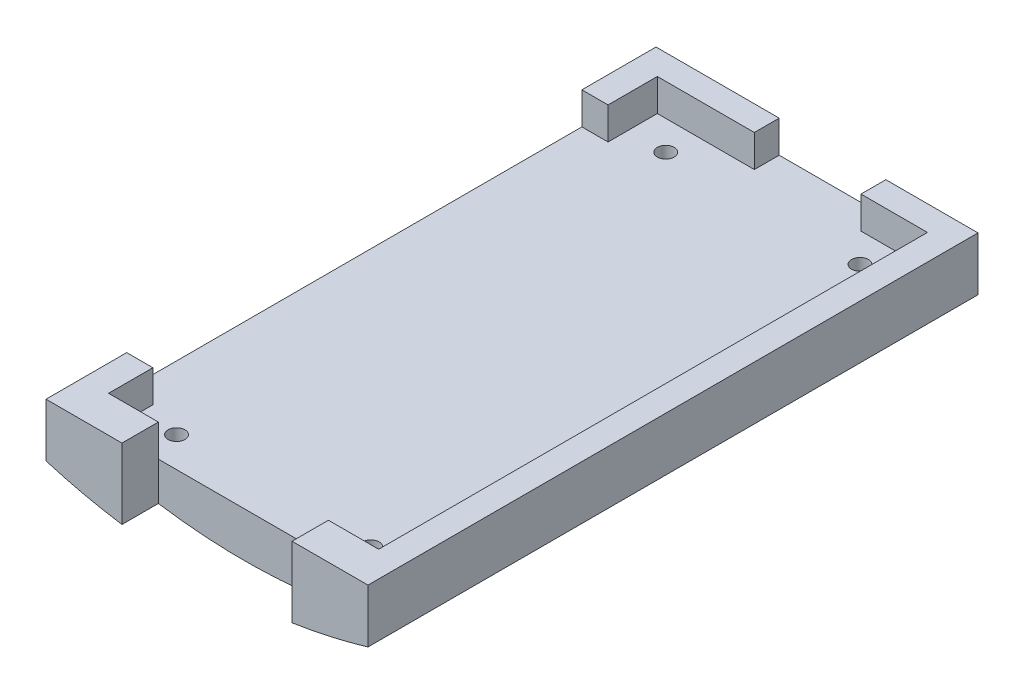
ISO-10303-21;
HEADER;
FILE_DESCRIPTION(('STEP AP214'),'2;1');
FILE_NAME('part.step','',(''),(''),'','','');
FILE_SCHEMA(('AUTOMOTIVE_DESIGN { 1 0 10303 214 1 1 1 1 }'));
ENDSEC;
DATA;
#1=APPLICATION_CONTEXT('core data for automotive mechanical design processes');
#2=APPLICATION_PROTOCOL_DEFINITION('international standard','automotive_design',2000,#1);
#3=PRODUCT_CONTEXT('',#1,'mechanical');
#4=PRODUCT('Part','Part','',(#3));
#5=PRODUCT_RELATED_PRODUCT_CATEGORY('part','',(#4));
#6=PRODUCT_DEFINITION_FORMATION('','',#4);
#7=PRODUCT_DEFINITION_CONTEXT('part definition',#1,'design');
#8=PRODUCT_DEFINITION('design','',#6,#7);
#9=PRODUCT_DEFINITION_SHAPE('','',#8);
#10=(LENGTH_UNIT() NAMED_UNIT(*) SI_UNIT(.MILLI.,.METRE.));
#11=(NAMED_UNIT(*) PLANE_ANGLE_UNIT() SI_UNIT($,.RADIAN.));
#12=(NAMED_UNIT(*) SI_UNIT($,.STERADIAN.) SOLID_ANGLE_UNIT());
#13=UNCERTAINTY_MEASURE_WITH_UNIT(LENGTH_MEASURE(1.E-05),#10,'distance_accuracy_value','');
#14=(GEOMETRIC_REPRESENTATION_CONTEXT(3) GLOBAL_UNCERTAINTY_ASSIGNED_CONTEXT((#13)) GLOBAL_UNIT_ASSIGNED_CONTEXT((#10,
#11,#12)) REPRESENTATION_CONTEXT('',''));
#15=CARTESIAN_POINT('',(0.,0.,0.));
#16=DIRECTION('',(0.,0.,1.));
#17=DIRECTION('',(1.,0.,0.));
#18=AXIS2_PLACEMENT_3D('',#15,#16,#17);
#19=CARTESIAN_POINT('',(32.3115117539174,9.144,76.2));
#20=DIRECTION('',(0.,-1.,0.));
#21=DIRECTION('',(0.,0.,-1.));
#22=AXIS2_PLACEMENT_3D('',#19,#20,#21);
#23=PLANE('',#22);
#24=DIRECTION('',(0.,0.,1.));
#25=VECTOR('',#24,1.);
#26=CARTESIAN_POINT('',(-16.0272390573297,9.144,71.1496235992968));
#27=LINE('',#26,#25);
#28=CARTESIAN_POINT('',(-16.0272391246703,9.144,2.95086024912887));
#29=VERTEX_POINT('',#28);
#30=CARTESIAN_POINT('',(-16.0272390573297,9.144,8.79844168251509));
#31=VERTEX_POINT('',#30);
#32=EDGE_CURVE('E565',#29,#31,#27,.T.);
#33=ORIENTED_EDGE('',*,*,#32,.F.);
#34=DIRECTION('',(-1.,0.,0.));
#35=VECTOR('',#34,1.);
#36=CARTESIAN_POINT('',(16.0272390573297,9.144,2.95086024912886));
#37=LINE('',#36,#35);
#38=CARTESIAN_POINT('',(-4.51458368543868,9.144,2.95086024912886));
#39=VERTEX_POINT('',#38);
#40=EDGE_CURVE('E551',#39,#29,#37,.T.);
#41=ORIENTED_EDGE('',*,*,#40,.F.);
#42=DIRECTION('',(0.,0.,-1.));
#43=VECTOR('',#42,1.);
#44=CARTESIAN_POINT('',(-4.51458368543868,9.144,3.65778861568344));
#45=LINE('',#44,#43);
#46=CARTESIAN_POINT('',(-4.51458368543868,9.144,0.));
#47=VERTEX_POINT('',#46);
#48=EDGE_CURVE('E533',#39,#47,#45,.T.);
#49=ORIENTED_EDGE('',*,*,#48,.T.);
#50=DIRECTION('',(-1.,0.,0.));
#51=VECTOR('',#50,1.);
#52=CARTESIAN_POINT('',(32.3115117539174,9.144,0.));
#53=LINE('',#52,#51);
#54=CARTESIAN_POINT('',(-19.1333167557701,9.144,0.));
#55=VERTEX_POINT('',#54);
#56=EDGE_CURVE('E588',#47,#55,#53,.T.);
#57=ORIENTED_EDGE('',*,*,#56,.T.);
#58=DIRECTION('',(0.,0.,1.));
#59=VECTOR('',#58,1.);
#60=CARTESIAN_POINT('',(-19.1333167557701,9.144,76.2));
#61=LINE('',#60,#59);
#62=CARTESIAN_POINT('',(-19.1333167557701,9.144,8.79844168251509));
#63=VERTEX_POINT('',#62);
#64=EDGE_CURVE('E622',#55,#63,#61,.T.);
#65=ORIENTED_EDGE('',*,*,#64,.T.);
#66=DIRECTION('',(1.,0.,0.));
#67=VECTOR('',#66,1.);
#68=CARTESIAN_POINT('',(-19.1333167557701,9.144,8.79844168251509));
#69=LINE('',#68,#67);
#70=EDGE_CURVE('E506',#63,#31,#69,.T.);
#71=ORIENTED_EDGE('',*,*,#70,.T.);
#72=EDGE_LOOP('',(#33,#41,#49,#57,#65,#71));
#73=FACE_BOUND('',#72,.T.);
#74=ADVANCED_FACE('F36',(#73),#23,.F.);
#75=CARTESIAN_POINT('',(0.,5.334,0.));
#76=DIRECTION('',(0.,1.,0.));
#77=DIRECTION('',(0.,0.,1.));
#78=AXIS2_PLACEMENT_3D('',#75,#76,#77);
#79=PLANE('',#78);
#80=DIRECTION('',(1.,0.,0.));
#81=VECTOR('',#80,1.);
#82=CARTESIAN_POINT('',(-19.1333167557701,5.334,62.8147251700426));
#83=LINE('',#82,#81);
#84=CARTESIAN_POINT('',(-19.1333167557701,5.334,62.8147251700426));
#85=VERTEX_POINT('',#84);
#86=CARTESIAN_POINT('',(-16.0272390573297,5.334,62.8147251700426));
#87=VERTEX_POINT('',#86);
#88=EDGE_CURVE('E513',#85,#87,#83,.T.);
#89=ORIENTED_EDGE('',*,*,#88,.T.);
#90=DIRECTION('',(0.,0.,1.));
#91=VECTOR('',#90,1.);
#92=CARTESIAN_POINT('',(-16.0272390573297,5.334,71.1496235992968));
#93=LINE('',#92,#91);
#94=CARTESIAN_POINT('',(-16.0272390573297,5.334,68.0720071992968));
#95=VERTEX_POINT('',#94);
#96=EDGE_CURVE('E562',#87,#95,#93,.T.);
#97=ORIENTED_EDGE('',*,*,#96,.T.);
#98=DIRECTION('',(-1.,0.,0.));
#99=VECTOR('',#98,1.);
#100=CARTESIAN_POINT('',(-16.0272390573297,5.334,68.0720071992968));
#101=LINE('',#100,#99);
#102=CARTESIAN_POINT('',(-10.1195907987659,5.334,68.072));
#103=VERTEX_POINT('',#102);
#104=EDGE_CURVE('E491',#103,#95,#101,.T.);
#105=ORIENTED_EDGE('',*,*,#104,.F.);
#106=DIRECTION('',(-1.,0.,0.));
#107=VECTOR('',#106,1.);
#108=CARTESIAN_POINT('',(0.,5.334,68.072));
#109=LINE('',#108,#107);
#110=CARTESIAN_POINT('',(10.0615830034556,5.334,68.072));
#111=VERTEX_POINT('',#110);
#112=EDGE_CURVE('E629',#111,#103,#109,.T.);
#113=ORIENTED_EDGE('',*,*,#112,.F.);
#114=DIRECTION('',(-1.,0.,0.));
#115=VECTOR('',#114,1.);
#116=CARTESIAN_POINT('',(16.0272390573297,5.334,68.0720071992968));
#117=LINE('',#116,#115);
#118=CARTESIAN_POINT('',(16.0272390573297,5.334,68.0720071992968));
#119=VERTEX_POINT('',#118);
#120=EDGE_CURVE('E497',#119,#111,#117,.T.);
#121=ORIENTED_EDGE('',*,*,#120,.F.);
#122=DIRECTION('',(0.,0.,-1.));
#123=VECTOR('',#122,1.);
#124=CARTESIAN_POINT('',(16.0272390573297,5.334,71.1496235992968));
#125=LINE('',#124,#123);
#126=CARTESIAN_POINT('',(16.0272390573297,5.334,2.95086024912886));
#127=VERTEX_POINT('',#126);
#128=EDGE_CURVE('E561',#119,#127,#125,.T.);
#129=ORIENTED_EDGE('',*,*,#128,.T.);
#130=DIRECTION('',(-1.,0.,0.));
#131=VECTOR('',#130,1.);
#132=CARTESIAN_POINT('',(16.0272390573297,5.334,2.95086024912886));
#133=LINE('',#132,#131);
#134=CARTESIAN_POINT('',(8.13998359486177,5.334,2.95086024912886));
#135=VERTEX_POINT('',#134);
#136=EDGE_CURVE('E552',#127,#135,#133,.T.);
#137=ORIENTED_EDGE('',*,*,#136,.T.);
#138=DIRECTION('',(0.,0.,-1.));
#139=VECTOR('',#138,1.);
#140=CARTESIAN_POINT('',(8.13998359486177,5.334,3.65778861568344));
#141=LINE('',#140,#139);
#142=CARTESIAN_POINT('',(8.13998359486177,5.334,0.));
#143=VERTEX_POINT('',#142);
#144=EDGE_CURVE('E529',#135,#143,#141,.T.);
#145=ORIENTED_EDGE('',*,*,#144,.T.);
#146=DIRECTION('',(-1.,0.,0.));
#147=VECTOR('',#146,1.);
#148=CARTESIAN_POINT('',(0.,5.334,0.));
#149=LINE('',#148,#147);
#150=CARTESIAN_POINT('',(-4.51458368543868,5.334,0.));
#151=VERTEX_POINT('',#150);
#152=EDGE_CURVE('E536',#143,#151,#149,.T.);
#153=ORIENTED_EDGE('',*,*,#152,.T.);
#154=DIRECTION('',(0.,0.,-1.));
#155=VECTOR('',#154,1.);
#156=CARTESIAN_POINT('',(-4.51458368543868,5.334,3.65778861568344));
#157=LINE('',#156,#155);
#158=CARTESIAN_POINT('',(-4.51458368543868,5.334,2.95086024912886));
#159=VERTEX_POINT('',#158);
#160=EDGE_CURVE('E532',#159,#151,#157,.T.);
#161=ORIENTED_EDGE('',*,*,#160,.F.);
#162=CARTESIAN_POINT('',(-16.0272391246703,5.334,2.95086024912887));
#163=VERTEX_POINT('',#162);
#164=EDGE_CURVE('E546',#159,#163,#133,.T.);
#165=ORIENTED_EDGE('',*,*,#164,.T.);
#166=CARTESIAN_POINT('',(-16.0272390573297,5.334,8.79844168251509));
#167=VERTEX_POINT('',#166);
#168=EDGE_CURVE('E558',#163,#167,#93,.T.);
#169=ORIENTED_EDGE('',*,*,#168,.T.);
#170=DIRECTION('',(1.,0.,0.));
#171=VECTOR('',#170,1.);
#172=CARTESIAN_POINT('',(-19.1333167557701,5.334,8.79844168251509));
#173=LINE('',#172,#171);
#174=CARTESIAN_POINT('',(-19.1333167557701,5.334,8.79844168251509));
#175=VERTEX_POINT('',#174);
#176=EDGE_CURVE('E510',#175,#167,#173,.T.);
#177=ORIENTED_EDGE('',*,*,#176,.F.);
#178=DIRECTION('',(0.,0.,-1.));
#179=VECTOR('',#178,1.);
#180=CARTESIAN_POINT('',(-19.1333167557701,5.334,62.8147251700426));
#181=LINE('',#180,#179);
#182=EDGE_CURVE('E507',#85,#175,#181,.T.);
#183=ORIENTED_EDGE('',*,*,#182,.F.);
#184=EDGE_LOOP('',(#89,#97,#105,#113,#121,#129,#137,#145,#153,#161,#165,#169,#177,#183));
#185=FACE_BOUND('',#184,.T.);
#186=CARTESIAN_POINT('',(-11.5540075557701,5.334,64.47586038));
#187=DIRECTION('',(0.,-1.,0.));
#188=DIRECTION('',(0.,0.,-1.));
#189=AXIS2_PLACEMENT_3D('',#186,#187,#188);
#190=CIRCLE('',#189,1.);
#191=CARTESIAN_POINT('',(-11.5540075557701,5.334,63.47586038));
#192=VERTEX_POINT('',#191);
#193=EDGE_CURVE('E711',#192,#192,#190,.F.);
#194=ORIENTED_EDGE('',*,*,#193,.F.);
#195=EDGE_LOOP('',(#194));
#196=FACE_BOUND('',#195,.T.);
#197=CARTESIAN_POINT('',(11.4959997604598,5.334,64.47586038));
#198=DIRECTION('',(0.,-1.,0.));
#199=DIRECTION('',(0.,0.,-1.));
#200=AXIS2_PLACEMENT_3D('',#197,#198,#199);
#201=CIRCLE('',#200,1.);
#202=CARTESIAN_POINT('',(11.4959997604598,5.334,63.47586038));
#203=VERTEX_POINT('',#202);
#204=EDGE_CURVE('E351',#203,#203,#201,.F.);
#205=ORIENTED_EDGE('',*,*,#204,.F.);
#206=EDGE_LOOP('',(#205));
#207=FACE_BOUND('',#206,.T.);
#208=CARTESIAN_POINT('',(-11.5540075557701,5.334,6.4258698));
#209=DIRECTION('',(0.,-1.,0.));
#210=DIRECTION('',(0.,0.,-1.));
#211=AXIS2_PLACEMENT_3D('',#208,#209,#210);
#212=CIRCLE('',#211,1.);
#213=CARTESIAN_POINT('',(-11.5540075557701,5.334,5.4258698));
#214=VERTEX_POINT('',#213);
#215=EDGE_CURVE('E40',#214,#214,#212,.F.);
#216=ORIENTED_EDGE('',*,*,#215,.F.);
#217=EDGE_LOOP('',(#216));
#218=FACE_BOUND('',#217,.T.);
#219=CARTESIAN_POINT('',(11.4959997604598,5.334,6.4258825));
#220=DIRECTION('',(0.,-1.,0.));
#221=DIRECTION('',(0.,0.,-1.));
#222=AXIS2_PLACEMENT_3D('',#219,#220,#221);
#223=CIRCLE('',#222,1.);
#224=CARTESIAN_POINT('',(11.4959997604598,5.334,5.4258825));
#225=VERTEX_POINT('',#224);
#226=EDGE_CURVE('E715',#225,#225,#223,.F.);
#227=ORIENTED_EDGE('',*,*,#226,.F.);
#228=EDGE_LOOP('',(#227));
#229=FACE_BOUND('',#228,.T.);
#230=ADVANCED_FACE('F727',(#185,#196,#207,#218,#229),#79,.T.);
#231=CARTESIAN_POINT('',(16.0272390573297,5.334,71.1496235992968));
#232=DIRECTION('',(1.,0.,0.));
#233=DIRECTION('',(0.,0.,-1.));
#234=AXIS2_PLACEMENT_3D('',#231,#232,#233);
#235=PLANE('',#234);
#236=DIRECTION('',(0.,-1.,0.));
#237=VECTOR('',#236,1.);
#238=CARTESIAN_POINT('',(16.0272390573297,5.334,68.0720071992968));
#239=LINE('',#238,#237);
#240=CARTESIAN_POINT('',(16.0272390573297,9.144,68.0720071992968));
#241=VERTEX_POINT('',#240);
#242=EDGE_CURVE('E494',#241,#119,#239,.T.);
#243=ORIENTED_EDGE('',*,*,#242,.F.);
#244=DIRECTION('',(0.,0.,-1.));
#245=VECTOR('',#244,1.);
#246=CARTESIAN_POINT('',(16.0272390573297,9.144,71.1496235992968));
#247=LINE('',#246,#245);
#248=CARTESIAN_POINT('',(16.0272390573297,9.144,2.95086024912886));
#249=VERTEX_POINT('',#248);
#250=EDGE_CURVE('E568',#241,#249,#247,.T.);
#251=ORIENTED_EDGE('',*,*,#250,.T.);
#252=DIRECTION('',(0.,-1.,0.));
#253=VECTOR('',#252,1.);
#254=CARTESIAN_POINT('',(16.0272390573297,9.144,2.95086024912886));
#255=LINE('',#254,#253);
#256=EDGE_CURVE('E550',#249,#127,#255,.T.);
#257=ORIENTED_EDGE('',*,*,#256,.T.);
#258=ORIENTED_EDGE('',*,*,#128,.F.);
#259=EDGE_LOOP('',(#243,#251,#257,#258));
#260=FACE_BOUND('',#259,.T.);
#261=ADVANCED_FACE('F730',(#260),#235,.F.);
#262=CARTESIAN_POINT('',(-19.1333167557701,0.,76.2));
#263=DIRECTION('',(-1.,0.,0.));
#264=DIRECTION('',(0.,0.,1.));
#265=AXIS2_PLACEMENT_3D('',#262,#263,#264);
#266=PLANE('',#265);
#267=ORIENTED_EDGE('',*,*,#182,.T.);
#268=DIRECTION('',(0.,1.,0.));
#269=VECTOR('',#268,1.);
#270=CARTESIAN_POINT('',(-19.1333167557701,5.334,8.79844168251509));
#271=LINE('',#270,#269);
#272=EDGE_CURVE('E525',#175,#63,#271,.T.);
#273=ORIENTED_EDGE('',*,*,#272,.T.);
#274=ORIENTED_EDGE('',*,*,#64,.F.);
#275=DIRECTION('',(0.,-1.,0.));
#276=VECTOR('',#275,1.);
#277=CARTESIAN_POINT('',(-19.1333167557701,66.802,0.));
#278=LINE('',#277,#276);
#279=CARTESIAN_POINT('',(-19.1333167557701,2.79869232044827,0.));
#280=VERTEX_POINT('',#279);
#281=EDGE_CURVE('E619',#55,#280,#278,.T.);
#282=ORIENTED_EDGE('',*,*,#281,.T.);
#283=DIRECTION('',(0.,0.,-1.));
#284=VECTOR('',#283,1.);
#285=CARTESIAN_POINT('',(-19.1333167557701,2.79869232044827,72.39));
#286=LINE('',#285,#284);
#287=CARTESIAN_POINT('',(-19.1333167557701,2.79869232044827,72.39));
#288=VERTEX_POINT('',#287);
#289=EDGE_CURVE('E601',#280,#288,#286,.F.);
#290=ORIENTED_EDGE('',*,*,#289,.T.);
#291=DIRECTION('',(0.,-1.,0.));
#292=VECTOR('',#291,1.);
#293=CARTESIAN_POINT('',(-19.1333167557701,66.802,72.39));
#294=LINE('',#293,#292);
#295=CARTESIAN_POINT('',(-19.1333167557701,9.144,72.39));
#296=VERTEX_POINT('',#295);
#297=EDGE_CURVE('E599',#296,#288,#294,.T.);
#298=ORIENTED_EDGE('',*,*,#297,.F.);
#299=CARTESIAN_POINT('',(-19.1333167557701,9.144,62.8147251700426));
#300=VERTEX_POINT('',#299);
#301=EDGE_CURVE('E621',#300,#296,#61,.T.);
#302=ORIENTED_EDGE('',*,*,#301,.F.);
#303=DIRECTION('',(0.,1.,0.));
#304=VECTOR('',#303,1.);
#305=CARTESIAN_POINT('',(-19.1333167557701,5.334,62.8147251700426));
#306=LINE('',#305,#304);
#307=EDGE_CURVE('E515',#85,#300,#306,.T.);
#308=ORIENTED_EDGE('',*,*,#307,.F.);
#309=EDGE_LOOP('',(#267,#273,#274,#282,#290,#298,#302,#308));
#310=FACE_BOUND('',#309,.T.);
#311=ADVANCED_FACE('F737',(#310),#266,.T.);
#312=CARTESIAN_POINT('',(-16.0272390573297,5.334,71.1496235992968));
#313=DIRECTION('',(-1.,0.,0.));
#314=DIRECTION('',(0.,0.,1.));
#315=AXIS2_PLACEMENT_3D('',#312,#313,#314);
#316=PLANE('',#315);
#317=DIRECTION('',(0.,1.,0.));
#318=VECTOR('',#317,1.);
#319=CARTESIAN_POINT('',(-16.0272390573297,5.334,8.79844168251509));
#320=LINE('',#319,#318);
#321=EDGE_CURVE('E523',#167,#31,#320,.T.);
#322=ORIENTED_EDGE('',*,*,#321,.F.);
#323=ORIENTED_EDGE('',*,*,#168,.F.);
#324=DIRECTION('',(0.,-1.,0.));
#325=VECTOR('',#324,1.);
#326=CARTESIAN_POINT('',(-16.0272391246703,9.144,2.95086024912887));
#327=LINE('',#326,#325);
#328=EDGE_CURVE('E466',#29,#163,#327,.T.);
#329=ORIENTED_EDGE('',*,*,#328,.F.);
#330=ORIENTED_EDGE('',*,*,#32,.T.);
#331=EDGE_LOOP('',(#322,#323,#329,#330));
#332=FACE_BOUND('',#331,.T.);
#333=ADVANCED_FACE('F754',(#332),#316,.F.);
#334=CARTESIAN_POINT('',(-16.0272390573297,9.144,62.8147251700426));
#335=VERTEX_POINT('',#334);
#336=CARTESIAN_POINT('',(-16.0272390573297,9.144,68.0720071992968));
#337=VERTEX_POINT('',#336);
#338=EDGE_CURVE('E557',#335,#337,#27,.T.);
#339=ORIENTED_EDGE('',*,*,#338,.F.);
#340=DIRECTION('',(1.,0.,0.));
#341=VECTOR('',#340,1.);
#342=CARTESIAN_POINT('',(-19.1333167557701,9.144,62.8147251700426));
#343=LINE('',#342,#341);
#344=EDGE_CURVE('E511',#300,#335,#343,.T.);
#345=ORIENTED_EDGE('',*,*,#344,.F.);
#346=ORIENTED_EDGE('',*,*,#301,.T.);
#347=DIRECTION('',(1.,0.,0.));
#348=VECTOR('',#347,1.);
#349=CARTESIAN_POINT('',(0.,9.144,72.39));
#350=LINE('',#349,#348);
#351=CARTESIAN_POINT('',(-10.1195907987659,9.144,72.39));
#352=VERTEX_POINT('',#351);
#353=EDGE_CURVE('E593',#296,#352,#350,.T.);
#354=ORIENTED_EDGE('',*,*,#353,.T.);
#355=DIRECTION('',(0.,0.,1.));
#356=VECTOR('',#355,1.);
#357=CARTESIAN_POINT('',(-10.1195907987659,9.144,76.2));
#358=LINE('',#357,#356);
#359=CARTESIAN_POINT('',(-10.1195907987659,9.144,68.0720071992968));
#360=VERTEX_POINT('',#359);
#361=EDGE_CURVE('E625',#360,#352,#358,.T.);
#362=ORIENTED_EDGE('',*,*,#361,.F.);
#363=DIRECTION('',(1.,0.,0.));
#364=VECTOR('',#363,1.);
#365=CARTESIAN_POINT('',(-16.0272390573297,9.144,68.0720071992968));
#366=LINE('',#365,#364);
#367=EDGE_CURVE('E485',#337,#360,#366,.T.);
#368=ORIENTED_EDGE('',*,*,#367,.F.);
#369=EDGE_LOOP('',(#339,#345,#346,#354,#362,#368));
#370=FACE_BOUND('',#369,.T.);
#371=ADVANCED_FACE('F742',(#370),#23,.F.);
#372=CARTESIAN_POINT('',(16.0272390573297,9.144,2.95086024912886));
#373=DIRECTION('',(0.,0.,1.));
#374=DIRECTION('',(1.,0.,0.));
#375=AXIS2_PLACEMENT_3D('',#372,#373,#374);
#376=PLANE('',#375);
#377=ORIENTED_EDGE('',*,*,#164,.F.);
#378=DIRECTION('',(0.,1.,0.));
#379=VECTOR('',#378,1.);
#380=CARTESIAN_POINT('',(-4.51458368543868,9.144,2.95086024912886));
#381=LINE('',#380,#379);
#382=EDGE_CURVE('E632',#159,#39,#381,.T.);
#383=ORIENTED_EDGE('',*,*,#382,.T.);
#384=ORIENTED_EDGE('',*,*,#40,.T.);
#385=ORIENTED_EDGE('',*,*,#328,.T.);
#386=EDGE_LOOP('',(#377,#383,#384,#385));
#387=FACE_BOUND('',#386,.T.);
#388=ADVANCED_FACE('F769',(#387),#376,.T.);
#389=CARTESIAN_POINT('',(19.0753089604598,9.144,0.));
#390=VERTEX_POINT('',#389);
#391=CARTESIAN_POINT('',(8.13998359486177,9.144,0.));
#392=VERTEX_POINT('',#391);
#393=EDGE_CURVE('E589',#390,#392,#53,.T.);
#394=ORIENTED_EDGE('',*,*,#393,.T.);
#395=DIRECTION('',(0.,0.,-1.));
#396=VECTOR('',#395,1.);
#397=CARTESIAN_POINT('',(8.13998359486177,9.144,3.65778861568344));
#398=LINE('',#397,#396);
#399=CARTESIAN_POINT('',(8.13998359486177,9.144,2.95086024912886));
#400=VERTEX_POINT('',#399);
#401=EDGE_CURVE('E528',#400,#392,#398,.T.);
#402=ORIENTED_EDGE('',*,*,#401,.F.);
#403=EDGE_CURVE('E547',#249,#400,#37,.T.);
#404=ORIENTED_EDGE('',*,*,#403,.F.);
#405=ORIENTED_EDGE('',*,*,#250,.F.);
#406=DIRECTION('',(1.,0.,0.));
#407=VECTOR('',#406,1.);
#408=CARTESIAN_POINT('',(16.0272390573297,9.144,68.0720071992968));
#409=LINE('',#408,#407);
#410=CARTESIAN_POINT('',(10.0615830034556,9.144,68.0720071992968));
#411=VERTEX_POINT('',#410);
#412=EDGE_CURVE('E503',#411,#241,#409,.T.);
#413=ORIENTED_EDGE('',*,*,#412,.F.);
#414=DIRECTION('',(0.,0.,1.));
#415=VECTOR('',#414,1.);
#416=CARTESIAN_POINT('',(10.0615830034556,9.144,76.2));
#417=LINE('',#416,#415);
#418=CARTESIAN_POINT('',(10.0615830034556,9.144,72.39));
#419=VERTEX_POINT('',#418);
#420=EDGE_CURVE('E627',#411,#419,#417,.T.);
#421=ORIENTED_EDGE('',*,*,#420,.T.);
#422=CARTESIAN_POINT('',(19.0753089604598,9.144,72.39));
#423=VERTEX_POINT('',#422);
#424=EDGE_CURVE('E592',#419,#423,#350,.T.);
#425=ORIENTED_EDGE('',*,*,#424,.T.);
#426=DIRECTION('',(0.,0.,1.));
#427=VECTOR('',#426,1.);
#428=CARTESIAN_POINT('',(19.0753089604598,9.144,76.2));
#429=LINE('',#428,#427);
#430=EDGE_CURVE('E596',#390,#423,#429,.T.);
#431=ORIENTED_EDGE('',*,*,#430,.F.);
#432=EDGE_LOOP('',(#394,#402,#404,#405,#413,#421,#425,#431));
#433=FACE_BOUND('',#432,.T.);
#434=ADVANCED_FACE('F743',(#433),#23,.F.);
#435=CARTESIAN_POINT('',(0.,0.,68.072));
#436=DIRECTION('',(0.,0.,1.));
#437=DIRECTION('',(1.,0.,0.));
#438=AXIS2_PLACEMENT_3D('',#435,#436,#437);
#439=PLANE('',#438);
#440=DIRECTION('',(0.,1.,0.));
#441=VECTOR('',#440,1.);
#442=CARTESIAN_POINT('',(10.0615830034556,-8.81629313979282,68.072));
#443=LINE('',#442,#441);
#444=CARTESIAN_POINT('',(10.0615830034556,0.762074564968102,68.072));
#445=VERTEX_POINT('',#444);
#446=EDGE_CURVE('E570',#445,#111,#443,.T.);
#447=ORIENTED_EDGE('',*,*,#446,.T.);
#448=ORIENTED_EDGE('',*,*,#112,.T.);
#449=DIRECTION('',(0.,1.,0.));
#450=VECTOR('',#449,1.);
#451=CARTESIAN_POINT('',(-10.1195907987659,-8.81629313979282,68.072));
#452=LINE('',#451,#450);
#453=CARTESIAN_POINT('',(-10.1195907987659,0.770938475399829,68.072));
#454=VERTEX_POINT('',#453);
#455=EDGE_CURVE('E573',#454,#103,#452,.T.);
#456=ORIENTED_EDGE('',*,*,#455,.F.);
#457=CARTESIAN_POINT('',(0.,66.802,68.072));
#458=DIRECTION('',(0.,0.,1.));
#459=DIRECTION('',(1.,0.,0.));
#460=AXIS2_PLACEMENT_3D('',#457,#458,#459);
#461=CIRCLE('',#460,66.802);
#462=EDGE_CURVE('E577',#454,#445,#461,.T.);
#463=ORIENTED_EDGE('',*,*,#462,.T.);
#464=EDGE_LOOP('',(#447,#448,#456,#463));
#465=FACE_BOUND('',#464,.T.);
#466=ADVANCED_FACE('F755',(#465),#439,.T.);
#467=CARTESIAN_POINT('',(0.,66.802,72.39));
#468=DIRECTION('',(0.,0.,1.));
#469=DIRECTION('',(1.,0.,0.));
#470=AXIS2_PLACEMENT_3D('',#467,#468,#469);
#471=PLANE('',#470);
#472=CARTESIAN_POINT('',(0.,66.802,72.39));
#473=DIRECTION('',(0.,0.,1.));
#474=DIRECTION('',(1.,0.,0.));
#475=AXIS2_PLACEMENT_3D('',#472,#473,#474);
#476=CIRCLE('',#475,66.802);
#477=CARTESIAN_POINT('',(-10.1195907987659,0.770938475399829,72.39));
#478=VERTEX_POINT('',#477);
#479=EDGE_CURVE('E611',#288,#478,#476,.T.);
#480=ORIENTED_EDGE('',*,*,#479,.T.);
#481=DIRECTION('',(0.,1.,0.));
#482=VECTOR('',#481,1.);
#483=CARTESIAN_POINT('',(-10.1195907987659,-8.81629313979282,72.39));
#484=LINE('',#483,#482);
#485=EDGE_CURVE('E574',#478,#352,#484,.T.);
#486=ORIENTED_EDGE('',*,*,#485,.T.);
#487=ORIENTED_EDGE('',*,*,#353,.F.);
#488=ORIENTED_EDGE('',*,*,#297,.T.);
#489=EDGE_LOOP('',(#480,#486,#487,#488));
#490=FACE_BOUND('',#489,.T.);
#491=ADVANCED_FACE('F758',(#490),#471,.T.);
#492=CARTESIAN_POINT('',(0.,66.802,72.39));
#493=DIRECTION('',(0.,0.,-1.));
#494=DIRECTION('',(-1.,0.,0.));
#495=AXIS2_PLACEMENT_3D('',#492,#493,#494);
#496=CYLINDRICAL_SURFACE('',#495,66.802);
#497=CARTESIAN_POINT('',(0.,66.802,-2.46300210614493));
#498=DIRECTION('',(0.5,0.,-0.866025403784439));
#499=DIRECTION('',(-0.866025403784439,0.,-0.5));
#500=AXIS2_PLACEMENT_3D('',#497,#498,#499);
#501=ELLIPSE('',#500,77.1363053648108,66.802);
#502=CARTESIAN_POINT('',(13.4459997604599,1.36720578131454,5.30004947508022));
#503=VERTEX_POINT('',#502);
#504=CARTESIAN_POINT('',(11.4959997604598,0.99661121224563,4.17421645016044));
#505=VERTEX_POINT('',#504);
#506=EDGE_CURVE('E695',#503,#505,#501,.T.);
#507=ORIENTED_EDGE('',*,*,#506,.T.);
#508=CARTESIAN_POINT('',(0.,66.802,10.8114350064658));
#509=DIRECTION('',(-0.5,0.,-0.866025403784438));
#510=DIRECTION('',(0.866025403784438,0.,-0.5));
#511=AXIS2_PLACEMENT_3D('',#508,#509,#510);
#512=ELLIPSE('',#511,77.1363053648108,66.802);
#513=CARTESIAN_POINT('',(9.54599976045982,0.685579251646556,5.30004947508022));
#514=VERTEX_POINT('',#513);
#515=EDGE_CURVE('E11',#505,#514,#512,.T.);
#516=ORIENTED_EDGE('',*,*,#515,.T.);
#517=DIRECTION('',(0.,0.,-1.));
#518=VECTOR('',#517,1.);
#519=CARTESIAN_POINT('',(9.54599976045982,0.685579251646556,72.39));
#520=LINE('',#519,#518);
#521=CARTESIAN_POINT('',(9.54599976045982,0.685579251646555,7.55171552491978));
#522=VERTEX_POINT('',#521);
#523=EDGE_CURVE('E45',#514,#522,#520,.F.);
#524=ORIENTED_EDGE('',*,*,#523,.T.);
#525=CARTESIAN_POINT('',(0.,66.802,2.04032999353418));
#526=DIRECTION('',(-0.500000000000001,0.,0.866025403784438));
#527=DIRECTION('',(-0.866025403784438,0.,-0.500000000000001));
#528=AXIS2_PLACEMENT_3D('',#525,#526,#527);
#529=ELLIPSE('',#528,77.1363053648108,66.802);
#530=CARTESIAN_POINT('',(11.4959997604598,0.99661121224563,8.67754854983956));
#531=VERTEX_POINT('',#530);
#532=EDGE_CURVE('E703',#522,#531,#529,.T.);
#533=ORIENTED_EDGE('',*,*,#532,.T.);
#534=CARTESIAN_POINT('',(0.,66.802,15.3147671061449));
#535=DIRECTION('',(0.5,0.,0.866025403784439));
#536=DIRECTION('',(0.866025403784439,0.,-0.5));
#537=AXIS2_PLACEMENT_3D('',#534,#535,#536);
#538=ELLIPSE('',#537,77.1363053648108,66.802);
#539=CARTESIAN_POINT('',(13.4459997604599,1.36720578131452,7.55171552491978));
#540=VERTEX_POINT('',#539);
#541=EDGE_CURVE('E700',#531,#540,#538,.T.);
#542=ORIENTED_EDGE('',*,*,#541,.T.);
#543=DIRECTION('',(0.,0.,-1.));
#544=VECTOR('',#543,1.);
#545=CARTESIAN_POINT('',(13.4459997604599,1.36720578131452,72.39));
#546=LINE('',#545,#544);
#547=EDGE_CURVE('E697',#540,#503,#546,.T.);
#548=ORIENTED_EDGE('',*,*,#547,.T.);
#549=EDGE_LOOP('',(#507,#516,#524,#533,#542,#548));
#550=FACE_BOUND('',#549,.T.);
#551=CARTESIAN_POINT('',(0.,66.802,10.8449131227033));
#552=DIRECTION('',(0.5,0.,-0.866025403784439));
#553=DIRECTION('',(-0.866025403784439,0.,-0.5));
#554=AXIS2_PLACEMENT_3D('',#551,#552,#553);
#555=ELLIPSE('',#554,77.1363053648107,66.802);
#556=CARTESIAN_POINT('',(-9.60400755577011,0.693980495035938,5.30003677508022));
#557=VERTEX_POINT('',#556);
#558=CARTESIAN_POINT('',(-11.5540075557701,1.00677134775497,4.17420375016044));
#559=VERTEX_POINT('',#558);
#560=EDGE_CURVE('E675',#557,#559,#555,.T.);
#561=ORIENTED_EDGE('',*,*,#560,.T.);
#562=CARTESIAN_POINT('',(0.,66.802,-2.49650562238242));
#563=DIRECTION('',(-0.5,0.,-0.866025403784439));
#564=DIRECTION('',(0.866025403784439,0.,-0.5));
#565=AXIS2_PLACEMENT_3D('',#562,#563,#564);
#566=ELLIPSE('',#565,77.1363053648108,66.802);
#567=CARTESIAN_POINT('',(-13.5040075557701,1.37915243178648,5.30003677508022));
#568=VERTEX_POINT('',#567);
#569=EDGE_CURVE('E692',#559,#568,#566,.T.);
#570=ORIENTED_EDGE('',*,*,#569,.T.);
#571=DIRECTION('',(0.,0.,-1.));
#572=VECTOR('',#571,1.);
#573=CARTESIAN_POINT('',(-13.5040075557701,1.37915243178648,72.39));
#574=LINE('',#573,#572);
#575=CARTESIAN_POINT('',(-13.5040075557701,1.37915243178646,7.55170282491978));
#576=VERTEX_POINT('',#575);
#577=EDGE_CURVE('E689',#568,#576,#574,.F.);
#578=ORIENTED_EDGE('',*,*,#577,.T.);
#579=CARTESIAN_POINT('',(0.,66.802,15.3482452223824));
#580=DIRECTION('',(-0.5,0.,0.866025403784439));
#581=DIRECTION('',(-0.866025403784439,0.,-0.5));
#582=AXIS2_PLACEMENT_3D('',#579,#580,#581);
#583=ELLIPSE('',#582,77.1363053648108,66.802);
#584=CARTESIAN_POINT('',(-11.5540075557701,1.00677134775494,8.67753584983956));
#585=VERTEX_POINT('',#584);
#586=EDGE_CURVE('E686',#576,#585,#583,.T.);
#587=ORIENTED_EDGE('',*,*,#586,.T.);
#588=CARTESIAN_POINT('',(0.,66.802,2.00682647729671));
#589=DIRECTION('',(0.5,0.,0.866025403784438));
#590=DIRECTION('',(0.866025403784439,0.,-0.5));
#591=AXIS2_PLACEMENT_3D('',#588,#589,#590);
#592=ELLIPSE('',#591,77.1363053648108,66.802);
#593=CARTESIAN_POINT('',(-9.60400755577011,0.693980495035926,7.55170282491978));
#594=VERTEX_POINT('',#593);
#595=EDGE_CURVE('E683',#585,#594,#592,.T.);
#596=ORIENTED_EDGE('',*,*,#595,.T.);
#597=DIRECTION('',(0.,0.,-1.));
#598=VECTOR('',#597,1.);
#599=CARTESIAN_POINT('',(-9.60400755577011,0.693980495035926,72.39));
#600=LINE('',#599,#598);
#601=EDGE_CURVE('E680',#594,#557,#600,.T.);
#602=ORIENTED_EDGE('',*,*,#601,.T.);
#603=EDGE_LOOP('',(#561,#570,#578,#587,#596,#602));
#604=FACE_BOUND('',#603,.T.);
#605=CARTESIAN_POINT('',(0.,66.802,68.8949037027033));
#606=DIRECTION('',(0.500000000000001,0.,-0.866025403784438));
#607=DIRECTION('',(-0.866025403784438,0.,-0.500000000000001));
#608=AXIS2_PLACEMENT_3D('',#605,#606,#607);
#609=ELLIPSE('',#608,77.1363053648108,66.802);
#610=CARTESIAN_POINT('',(-9.60400755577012,0.693980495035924,63.3500273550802));
#611=VERTEX_POINT('',#610);
#612=CARTESIAN_POINT('',(-11.5540075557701,1.00677134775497,62.2241943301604));
#613=VERTEX_POINT('',#612);
#614=EDGE_CURVE('E655',#611,#613,#609,.T.);
#615=ORIENTED_EDGE('',*,*,#614,.T.);
#616=CARTESIAN_POINT('',(0.,66.802,55.5534849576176));
#617=DIRECTION('',(-0.499999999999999,0.,-0.866025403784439));
#618=DIRECTION('',(0.866025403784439,0.,-0.499999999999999));
#619=AXIS2_PLACEMENT_3D('',#616,#617,#618);
#620=ELLIPSE('',#619,77.1363053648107,66.802);
#621=CARTESIAN_POINT('',(-13.5040075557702,1.37915243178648,63.3500273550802));
#622=VERTEX_POINT('',#621);
#623=EDGE_CURVE('E672',#613,#622,#620,.T.);
#624=ORIENTED_EDGE('',*,*,#623,.T.);
#625=DIRECTION('',(0.,0.,-1.));
#626=VECTOR('',#625,1.);
#627=CARTESIAN_POINT('',(-13.5040075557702,1.37915243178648,72.39));
#628=LINE('',#627,#626);
#629=CARTESIAN_POINT('',(-13.5040075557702,1.37915243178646,65.6016934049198));
#630=VERTEX_POINT('',#629);
#631=EDGE_CURVE('E669',#622,#630,#628,.F.);
#632=ORIENTED_EDGE('',*,*,#631,.T.);
#633=CARTESIAN_POINT('',(0.,66.802,73.3982358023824));
#634=DIRECTION('',(-0.499999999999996,0.,0.866025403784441));
#635=DIRECTION('',(-0.866025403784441,0.,-0.499999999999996));
#636=AXIS2_PLACEMENT_3D('',#633,#634,#635);
#637=ELLIPSE('',#636,77.1363053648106,66.802);
#638=CARTESIAN_POINT('',(-11.5540075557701,1.00677134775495,66.7275264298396));
#639=VERTEX_POINT('',#638);
#640=EDGE_CURVE('E666',#630,#639,#637,.T.);
#641=ORIENTED_EDGE('',*,*,#640,.T.);
#642=CARTESIAN_POINT('',(0.,66.802,60.0568170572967));
#643=DIRECTION('',(0.5,0.,0.866025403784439));
#644=DIRECTION('',(0.866025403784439,0.,-0.5));
#645=AXIS2_PLACEMENT_3D('',#642,#643,#644);
#646=ELLIPSE('',#645,77.1363053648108,66.802);
#647=CARTESIAN_POINT('',(-9.60400755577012,0.693980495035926,65.6016934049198));
#648=VERTEX_POINT('',#647);
#649=EDGE_CURVE('E663',#639,#648,#646,.T.);
#650=ORIENTED_EDGE('',*,*,#649,.T.);
#651=DIRECTION('',(0.,0.,-1.));
#652=VECTOR('',#651,1.);
#653=CARTESIAN_POINT('',(-9.60400755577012,0.693980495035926,72.39));
#654=LINE('',#653,#652);
#655=EDGE_CURVE('E660',#648,#611,#654,.T.);
#656=ORIENTED_EDGE('',*,*,#655,.T.);
#657=EDGE_LOOP('',(#615,#624,#632,#641,#650,#656));
#658=FACE_BOUND('',#657,.T.);
#659=CARTESIAN_POINT('',(0.,66.802,55.5869757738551));
#660=DIRECTION('',(0.5,0.,-0.866025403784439));
#661=DIRECTION('',(-0.866025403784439,0.,-0.5));
#662=AXIS2_PLACEMENT_3D('',#659,#660,#661);
#663=ELLIPSE('',#662,77.1363053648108,66.802);
#664=CARTESIAN_POINT('',(13.4459997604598,1.36720578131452,63.3500273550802));
#665=VERTEX_POINT('',#664);
#666=CARTESIAN_POINT('',(11.4959997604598,0.99661121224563,62.2241943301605));
#667=VERTEX_POINT('',#666);
#668=EDGE_CURVE('E637',#665,#667,#663,.T.);
#669=ORIENTED_EDGE('',*,*,#668,.T.);
#670=CARTESIAN_POINT('',(0.,66.802,68.8614128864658));
#671=DIRECTION('',(-0.500000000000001,0.,-0.866025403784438));
#672=DIRECTION('',(0.866025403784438,0.,-0.500000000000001));
#673=AXIS2_PLACEMENT_3D('',#670,#671,#672);
#674=ELLIPSE('',#673,77.1363053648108,66.802);
#675=CARTESIAN_POINT('',(9.54599976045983,0.685579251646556,63.3500273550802));
#676=VERTEX_POINT('',#675);
#677=EDGE_CURVE('E652',#667,#676,#674,.T.);
#678=ORIENTED_EDGE('',*,*,#677,.T.);
#679=DIRECTION('',(0.,0.,-1.));
#680=VECTOR('',#679,1.);
#681=CARTESIAN_POINT('',(9.54599976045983,0.685579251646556,72.39));
#682=LINE('',#681,#680);
#683=CARTESIAN_POINT('',(9.54599976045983,0.685579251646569,65.6016934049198));
#684=VERTEX_POINT('',#683);
#685=EDGE_CURVE('E649',#676,#684,#682,.F.);
#686=ORIENTED_EDGE('',*,*,#685,.T.);
#687=CARTESIAN_POINT('',(0.,66.802,60.0903078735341));
#688=DIRECTION('',(-0.500000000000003,0.,0.866025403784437));
#689=DIRECTION('',(-0.866025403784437,0.,-0.500000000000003));
#690=AXIS2_PLACEMENT_3D('',#687,#688,#689);
#691=ELLIPSE('',#690,77.1363053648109,66.802);
#692=CARTESIAN_POINT('',(11.4959997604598,0.996611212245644,66.7275264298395));
#693=VERTEX_POINT('',#692);
#694=EDGE_CURVE('E646',#684,#693,#691,.T.);
#695=ORIENTED_EDGE('',*,*,#694,.T.);
#696=CARTESIAN_POINT('',(0.,66.802,73.364744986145));
#697=DIRECTION('',(0.500000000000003,0.,0.866025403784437));
#698=DIRECTION('',(0.866025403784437,0.,-0.500000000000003));
#699=AXIS2_PLACEMENT_3D('',#696,#697,#698);
#700=ELLIPSE('',#699,77.1363053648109,66.802);
#701=CARTESIAN_POINT('',(13.4459997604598,1.36720578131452,65.6016934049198));
#702=VERTEX_POINT('',#701);
#703=EDGE_CURVE('E643',#693,#702,#700,.T.);
#704=ORIENTED_EDGE('',*,*,#703,.T.);
#705=DIRECTION('',(0.,0.,-1.));
#706=VECTOR('',#705,1.);
#707=CARTESIAN_POINT('',(13.4459997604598,1.36720578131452,72.39));
#708=LINE('',#707,#706);
#709=EDGE_CURVE('E640',#702,#665,#708,.T.);
#710=ORIENTED_EDGE('',*,*,#709,.T.);
#711=EDGE_LOOP('',(#669,#678,#686,#695,#704,#710));
#712=FACE_BOUND('',#711,.T.);
#713=CARTESIAN_POINT('',(10.0615830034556,0.762074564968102,72.39));
#714=VERTEX_POINT('',#713);
#715=CARTESIAN_POINT('',(19.0753089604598,2.78137994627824,72.39));
#716=VERTEX_POINT('',#715);
#717=EDGE_CURVE('E615',#714,#716,#476,.T.);
#718=ORIENTED_EDGE('',*,*,#717,.F.);
#719=DIRECTION('',(0.,0.,-1.));
#720=VECTOR('',#719,1.);
#721=CARTESIAN_POINT('',(10.0615830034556,0.762074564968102,72.39));
#722=LINE('',#721,#720);
#723=EDGE_CURVE('E585',#714,#445,#722,.T.);
#724=ORIENTED_EDGE('',*,*,#723,.T.);
#725=ORIENTED_EDGE('',*,*,#462,.F.);
#726=DIRECTION('',(0.,0.,-1.));
#727=VECTOR('',#726,1.);
#728=CARTESIAN_POINT('',(-10.1195907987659,0.770938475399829,72.39));
#729=LINE('',#728,#727);
#730=EDGE_CURVE('E583',#478,#454,#729,.T.);
#731=ORIENTED_EDGE('',*,*,#730,.F.);
#732=ORIENTED_EDGE('',*,*,#479,.F.);
#733=ORIENTED_EDGE('',*,*,#289,.F.);
#734=CARTESIAN_POINT('',(0.,66.802,0.));
#735=DIRECTION('',(0.,0.,1.));
#736=DIRECTION('',(1.,0.,0.));
#737=AXIS2_PLACEMENT_3D('',#734,#735,#736);
#738=CIRCLE('',#737,66.802);
#739=CARTESIAN_POINT('',(19.0753089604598,2.78137994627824,0.));
#740=VERTEX_POINT('',#739);
#741=EDGE_CURVE('E610',#280,#740,#738,.T.);
#742=ORIENTED_EDGE('',*,*,#741,.T.);
#743=DIRECTION('',(0.,0.,-1.));
#744=VECTOR('',#743,1.);
#745=CARTESIAN_POINT('',(19.0753089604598,2.78137994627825,72.39));
#746=LINE('',#745,#744);
#747=EDGE_CURVE('E607',#740,#716,#746,.F.);
#748=ORIENTED_EDGE('',*,*,#747,.T.);
#749=EDGE_LOOP('',(#718,#724,#725,#731,#732,#733,#742,#748));
#750=FACE_BOUND('',#749,.T.);
#751=ADVANCED_FACE('F38',(#550,#604,#658,#712,#750),#496,.T.);
#752=DIRECTION('',(0.,1.,0.));
#753=VECTOR('',#752,1.);
#754=CARTESIAN_POINT('',(10.0615830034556,-8.81629313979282,72.39));
#755=LINE('',#754,#753);
#756=EDGE_CURVE('E564',#714,#419,#755,.T.);
#757=ORIENTED_EDGE('',*,*,#756,.F.);
#758=ORIENTED_EDGE('',*,*,#717,.T.);
#759=DIRECTION('',(0.,-1.,0.));
#760=VECTOR('',#759,1.);
#761=CARTESIAN_POINT('',(19.0753089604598,66.802,72.39));
#762=LINE('',#761,#760);
#763=EDGE_CURVE('E604',#423,#716,#762,.T.);
#764=ORIENTED_EDGE('',*,*,#763,.F.);
#765=ORIENTED_EDGE('',*,*,#424,.F.);
#766=EDGE_LOOP('',(#757,#758,#764,#765));
#767=FACE_BOUND('',#766,.T.);
#768=ADVANCED_FACE('F778',(#767),#471,.T.);
#769=CARTESIAN_POINT('',(0.,66.802,0.));
#770=DIRECTION('',(0.,0.,1.));
#771=DIRECTION('',(1.,0.,0.));
#772=AXIS2_PLACEMENT_3D('',#769,#770,#771);
#773=PLANE('',#772);
#774=ORIENTED_EDGE('',*,*,#152,.F.);
#775=DIRECTION('',(0.,1.,0.));
#776=VECTOR('',#775,1.);
#777=CARTESIAN_POINT('',(8.13998359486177,66.802,0.));
#778=LINE('',#777,#776);
#779=EDGE_CURVE('E543',#143,#392,#778,.T.);
#780=ORIENTED_EDGE('',*,*,#779,.T.);
#781=ORIENTED_EDGE('',*,*,#393,.F.);
#782=DIRECTION('',(0.,-1.,0.));
#783=VECTOR('',#782,1.);
#784=CARTESIAN_POINT('',(19.0753089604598,66.802,0.));
#785=LINE('',#784,#783);
#786=EDGE_CURVE('E614',#390,#740,#785,.T.);
#787=ORIENTED_EDGE('',*,*,#786,.T.);
#788=ORIENTED_EDGE('',*,*,#741,.F.);
#789=ORIENTED_EDGE('',*,*,#281,.F.);
#790=ORIENTED_EDGE('',*,*,#56,.F.);
#791=DIRECTION('',(0.,1.,0.));
#792=VECTOR('',#791,1.);
#793=CARTESIAN_POINT('',(-4.51458368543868,66.802,0.));
#794=LINE('',#793,#792);
#795=EDGE_CURVE('E541',#151,#47,#794,.T.);
#796=ORIENTED_EDGE('',*,*,#795,.F.);
#797=EDGE_LOOP('',(#774,#780,#781,#787,#788,#789,#790,#796));
#798=FACE_BOUND('',#797,.T.);
#799=ADVANCED_FACE('F776',(#798),#773,.F.);
#800=CARTESIAN_POINT('',(19.0753089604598,0.,76.2));
#801=DIRECTION('',(-1.,0.,0.));
#802=DIRECTION('',(0.,0.,1.));
#803=AXIS2_PLACEMENT_3D('',#800,#801,#802);
#804=PLANE('',#803);
#805=ORIENTED_EDGE('',*,*,#786,.F.);
#806=ORIENTED_EDGE('',*,*,#430,.T.);
#807=ORIENTED_EDGE('',*,*,#763,.T.);
#808=ORIENTED_EDGE('',*,*,#747,.F.);
#809=EDGE_LOOP('',(#805,#806,#807,#808));
#810=FACE_BOUND('',#809,.T.);
#811=ADVANCED_FACE('F765',(#810),#804,.F.);
#812=CARTESIAN_POINT('',(10.0615830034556,-8.81629313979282,68.072));
#813=DIRECTION('',(1.,0.,0.));
#814=DIRECTION('',(0.,0.,-1.));
#815=AXIS2_PLACEMENT_3D('',#812,#813,#814);
#816=PLANE('',#815);
#817=ORIENTED_EDGE('',*,*,#420,.F.);
#818=DIRECTION('',(0.,1.,0.));
#819=VECTOR('',#818,1.);
#820=CARTESIAN_POINT('',(10.0615830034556,5.334,68.0720071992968));
#821=LINE('',#820,#819);
#822=EDGE_CURVE('E500',#111,#411,#821,.T.);
#823=ORIENTED_EDGE('',*,*,#822,.F.);
#824=ORIENTED_EDGE('',*,*,#446,.F.);
#825=ORIENTED_EDGE('',*,*,#723,.F.);
#826=ORIENTED_EDGE('',*,*,#756,.T.);
#827=EDGE_LOOP('',(#817,#823,#824,#825,#826));
#828=FACE_BOUND('',#827,.T.);
#829=ADVANCED_FACE('F762',(#828),#816,.F.);
#830=CARTESIAN_POINT('',(-10.1195907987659,-8.81629313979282,68.072));
#831=DIRECTION('',(1.,0.,0.));
#832=DIRECTION('',(0.,0.,-1.));
#833=AXIS2_PLACEMENT_3D('',#830,#831,#832);
#834=PLANE('',#833);
#835=ORIENTED_EDGE('',*,*,#455,.T.);
#836=DIRECTION('',(0.,-1.,0.));
#837=VECTOR('',#836,1.);
#838=CARTESIAN_POINT('',(-10.1195907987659,5.334,68.0720071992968));
#839=LINE('',#838,#837);
#840=EDGE_CURVE('E488',#360,#103,#839,.T.);
#841=ORIENTED_EDGE('',*,*,#840,.F.);
#842=ORIENTED_EDGE('',*,*,#361,.T.);
#843=ORIENTED_EDGE('',*,*,#485,.F.);
#844=ORIENTED_EDGE('',*,*,#730,.T.);
#845=EDGE_LOOP('',(#835,#841,#842,#843,#844));
#846=FACE_BOUND('',#845,.T.);
#847=ADVANCED_FACE('F752',(#846),#834,.T.);
#848=ORIENTED_EDGE('',*,*,#338,.T.);
#849=DIRECTION('',(0.,1.,0.));
#850=VECTOR('',#849,1.);
#851=CARTESIAN_POINT('',(-16.0272390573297,5.334,68.0720071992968));
#852=LINE('',#851,#850);
#853=EDGE_CURVE('E482',#95,#337,#852,.T.);
#854=ORIENTED_EDGE('',*,*,#853,.F.);
#855=ORIENTED_EDGE('',*,*,#96,.F.);
#856=DIRECTION('',(0.,1.,0.));
#857=VECTOR('',#856,1.);
#858=CARTESIAN_POINT('',(-16.0272390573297,5.334,62.8147251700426));
#859=LINE('',#858,#857);
#860=EDGE_CURVE('E520',#87,#335,#859,.T.);
#861=ORIENTED_EDGE('',*,*,#860,.T.);
#862=EDGE_LOOP('',(#848,#854,#855,#861));
#863=FACE_BOUND('',#862,.T.);
#864=ADVANCED_FACE('F749',(#863),#316,.F.);
#865=DIRECTION('',(0.,1.,0.));
#866=VECTOR('',#865,1.);
#867=CARTESIAN_POINT('',(8.13998359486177,9.144,2.95086024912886));
#868=LINE('',#867,#866);
#869=EDGE_CURVE('E635',#135,#400,#868,.T.);
#870=ORIENTED_EDGE('',*,*,#869,.F.);
#871=ORIENTED_EDGE('',*,*,#136,.F.);
#872=ORIENTED_EDGE('',*,*,#256,.F.);
#873=ORIENTED_EDGE('',*,*,#403,.T.);
#874=EDGE_LOOP('',(#870,#871,#872,#873));
#875=FACE_BOUND('',#874,.T.);
#876=ADVANCED_FACE('F746',(#875),#376,.T.);
#877=CARTESIAN_POINT('',(8.13998359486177,5.334,3.65778861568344));
#878=DIRECTION('',(1.,0.,0.));
#879=DIRECTION('',(0.,0.,-1.));
#880=AXIS2_PLACEMENT_3D('',#877,#878,#879);
#881=PLANE('',#880);
#882=ORIENTED_EDGE('',*,*,#144,.F.);
#883=ORIENTED_EDGE('',*,*,#869,.T.);
#884=ORIENTED_EDGE('',*,*,#401,.T.);
#885=ORIENTED_EDGE('',*,*,#779,.F.);
#886=EDGE_LOOP('',(#882,#883,#884,#885));
#887=FACE_BOUND('',#886,.T.);
#888=ADVANCED_FACE('F854',(#887),#881,.F.);
#889=CARTESIAN_POINT('',(-4.51458368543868,5.334,3.65778861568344));
#890=DIRECTION('',(1.,0.,0.));
#891=DIRECTION('',(0.,0.,-1.));
#892=AXIS2_PLACEMENT_3D('',#889,#890,#891);
#893=PLANE('',#892);
#894=ORIENTED_EDGE('',*,*,#795,.T.);
#895=ORIENTED_EDGE('',*,*,#48,.F.);
#896=ORIENTED_EDGE('',*,*,#382,.F.);
#897=ORIENTED_EDGE('',*,*,#160,.T.);
#898=EDGE_LOOP('',(#894,#895,#896,#897));
#899=FACE_BOUND('',#898,.T.);
#900=ADVANCED_FACE('F792',(#899),#893,.T.);
#901=CARTESIAN_POINT('',(-19.1333167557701,5.334,8.79844168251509));
#902=DIRECTION('',(0.,0.,1.));
#903=DIRECTION('',(1.,0.,0.));
#904=AXIS2_PLACEMENT_3D('',#901,#902,#903);
#905=PLANE('',#904);
#906=ORIENTED_EDGE('',*,*,#70,.F.);
#907=ORIENTED_EDGE('',*,*,#272,.F.);
#908=ORIENTED_EDGE('',*,*,#176,.T.);
#909=ORIENTED_EDGE('',*,*,#321,.T.);
#910=EDGE_LOOP('',(#906,#907,#908,#909));
#911=FACE_BOUND('',#910,.T.);
#912=ADVANCED_FACE('F802',(#911),#905,.T.);
#913=CARTESIAN_POINT('',(-19.1333167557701,5.334,62.8147251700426));
#914=DIRECTION('',(0.,0.,1.));
#915=DIRECTION('',(1.,0.,0.));
#916=AXIS2_PLACEMENT_3D('',#913,#914,#915);
#917=PLANE('',#916);
#918=ORIENTED_EDGE('',*,*,#344,.T.);
#919=ORIENTED_EDGE('',*,*,#860,.F.);
#920=ORIENTED_EDGE('',*,*,#88,.F.);
#921=ORIENTED_EDGE('',*,*,#307,.T.);
#922=EDGE_LOOP('',(#918,#919,#920,#921));
#923=FACE_BOUND('',#922,.T.);
#924=ADVANCED_FACE('F841',(#923),#917,.F.);
#925=CARTESIAN_POINT('',(0.,0.,68.0720071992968));
#926=DIRECTION('',(0.,0.,1.));
#927=DIRECTION('',(1.,0.,0.));
#928=AXIS2_PLACEMENT_3D('',#925,#926,#927);
#929=PLANE('',#928);
#930=ORIENTED_EDGE('',*,*,#242,.T.);
#931=ORIENTED_EDGE('',*,*,#120,.T.);
#932=ORIENTED_EDGE('',*,*,#822,.T.);
#933=ORIENTED_EDGE('',*,*,#412,.T.);
#934=EDGE_LOOP('',(#930,#931,#932,#933));
#935=FACE_BOUND('',#934,.T.);
#936=ADVANCED_FACE('F822',(#935),#929,.F.);
#937=CARTESIAN_POINT('',(0.,0.,68.0720071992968));
#938=DIRECTION('',(0.,0.,-1.));
#939=DIRECTION('',(-1.,0.,0.));
#940=AXIS2_PLACEMENT_3D('',#937,#938,#939);
#941=PLANE('',#940);
#942=ORIENTED_EDGE('',*,*,#853,.T.);
#943=ORIENTED_EDGE('',*,*,#367,.T.);
#944=ORIENTED_EDGE('',*,*,#840,.T.);
#945=ORIENTED_EDGE('',*,*,#104,.T.);
#946=EDGE_LOOP('',(#942,#943,#944,#945));
#947=FACE_BOUND('',#946,.T.);
#948=ADVANCED_FACE('F828',(#947),#941,.T.);
#949=CARTESIAN_POINT('',(9.54599976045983,2.984,63.3500273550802));
#950=DIRECTION('',(-0.500000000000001,0.,-0.866025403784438));
#951=DIRECTION('',(-0.866025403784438,0.,0.500000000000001));
#952=AXIS2_PLACEMENT_3D('',#949,#950,#951);
#953=PLANE('',#952);
#954=DIRECTION('',(0.,-1.,0.));
#955=VECTOR('',#954,1.);
#956=CARTESIAN_POINT('',(11.4959997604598,2.984,62.2241943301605));
#957=LINE('',#956,#955);
#958=CARTESIAN_POINT('',(11.4959997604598,2.984,62.2241943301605));
#959=VERTEX_POINT('',#958);
#960=EDGE_CURVE('E462',#959,#667,#957,.T.);
#961=ORIENTED_EDGE('',*,*,#960,.F.);
#962=DIRECTION('',(0.866025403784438,0.,-0.500000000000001));
#963=VECTOR('',#962,1.);
#964=CARTESIAN_POINT('',(9.54599976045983,2.984,63.3500273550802));
#965=LINE('',#964,#963);
#966=CARTESIAN_POINT('',(9.54599976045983,2.984,63.3500273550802));
#967=VERTEX_POINT('',#966);
#968=EDGE_CURVE('E444',#967,#959,#965,.T.);
#969=ORIENTED_EDGE('',*,*,#968,.F.);
#970=DIRECTION('',(0.,-1.,0.));
#971=VECTOR('',#970,1.);
#972=CARTESIAN_POINT('',(9.54599976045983,2.984,63.3500273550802));
#973=LINE('',#972,#971);
#974=EDGE_CURVE('E463',#967,#676,#973,.T.);
#975=ORIENTED_EDGE('',*,*,#974,.T.);
#976=ORIENTED_EDGE('',*,*,#677,.F.);
#977=EDGE_LOOP('',(#961,#969,#975,#976));
#978=FACE_BOUND('',#977,.T.);
#979=ADVANCED_FACE('F946',(#978),#953,.F.);
#980=CARTESIAN_POINT('',(9.54599976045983,2.984,65.6016934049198));
#981=DIRECTION('',(-1.,0.,0.));
#982=DIRECTION('',(0.,0.,1.));
#983=AXIS2_PLACEMENT_3D('',#980,#981,#982);
#984=PLANE('',#983);
#985=ORIENTED_EDGE('',*,*,#974,.F.);
#986=DIRECTION('',(0.,0.,-1.));
#987=VECTOR('',#986,1.);
#988=CARTESIAN_POINT('',(9.54599976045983,2.984,65.6016934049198));
#989=LINE('',#988,#987);
#990=CARTESIAN_POINT('',(9.54599976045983,2.984,65.6016934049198));
#991=VERTEX_POINT('',#990);
#992=EDGE_CURVE('E459',#991,#967,#989,.T.);
#993=ORIENTED_EDGE('',*,*,#992,.F.);
#994=DIRECTION('',(0.,-1.,0.));
#995=VECTOR('',#994,1.);
#996=CARTESIAN_POINT('',(9.54599976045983,2.984,65.6016934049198));
#997=LINE('',#996,#995);
#998=EDGE_CURVE('E467',#991,#684,#997,.T.);
#999=ORIENTED_EDGE('',*,*,#998,.T.);
#1000=ORIENTED_EDGE('',*,*,#685,.F.);
#1001=EDGE_LOOP('',(#985,#993,#999,#1000));
#1002=FACE_BOUND('',#1001,.T.);
#1003=ADVANCED_FACE('F985',(#1002),#984,.F.);
#1004=CARTESIAN_POINT('',(11.4959997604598,2.984,66.7275264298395));
#1005=DIRECTION('',(-0.500000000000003,0.,0.866025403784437));
#1006=DIRECTION('',(0.866025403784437,0.,0.500000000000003));
#1007=AXIS2_PLACEMENT_3D('',#1004,#1005,#1006);
#1008=PLANE('',#1007);
#1009=ORIENTED_EDGE('',*,*,#998,.F.);
#1010=DIRECTION('',(-0.866025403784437,0.,-0.500000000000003));
#1011=VECTOR('',#1010,1.);
#1012=CARTESIAN_POINT('',(11.4959997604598,2.984,66.7275264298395));
#1013=LINE('',#1012,#1011);
#1014=CARTESIAN_POINT('',(11.4959997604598,2.984,66.7275264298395));
#1015=VERTEX_POINT('',#1014);
#1016=EDGE_CURVE('E456',#1015,#991,#1013,.T.);
#1017=ORIENTED_EDGE('',*,*,#1016,.F.);
#1018=DIRECTION('',(0.,-1.,0.));
#1019=VECTOR('',#1018,1.);
#1020=CARTESIAN_POINT('',(11.4959997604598,2.984,66.7275264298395));
#1021=LINE('',#1020,#1019);
#1022=EDGE_CURVE('E470',#1015,#693,#1021,.T.);
#1023=ORIENTED_EDGE('',*,*,#1022,.T.);
#1024=ORIENTED_EDGE('',*,*,#694,.F.);
#1025=EDGE_LOOP('',(#1009,#1017,#1023,#1024));
#1026=FACE_BOUND('',#1025,.T.);
#1027=ADVANCED_FACE('F994',(#1026),#1008,.F.);
#1028=CARTESIAN_POINT('',(13.4459997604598,2.984,65.6016934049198));
#1029=DIRECTION('',(0.500000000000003,0.,0.866025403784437));
#1030=DIRECTION('',(0.866025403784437,0.,-0.500000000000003));
#1031=AXIS2_PLACEMENT_3D('',#1028,#1029,#1030);
#1032=PLANE('',#1031);
#1033=ORIENTED_EDGE('',*,*,#1022,.F.);
#1034=DIRECTION('',(-0.866025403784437,0.,0.500000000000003));
#1035=VECTOR('',#1034,1.);
#1036=CARTESIAN_POINT('',(13.4459997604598,2.984,65.6016934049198));
#1037=LINE('',#1036,#1035);
#1038=CARTESIAN_POINT('',(13.4459997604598,2.984,65.6016934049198));
#1039=VERTEX_POINT('',#1038);
#1040=EDGE_CURVE('E453',#1039,#1015,#1037,.T.);
#1041=ORIENTED_EDGE('',*,*,#1040,.F.);
#1042=DIRECTION('',(0.,-1.,0.));
#1043=VECTOR('',#1042,1.);
#1044=CARTESIAN_POINT('',(13.4459997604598,2.984,65.6016934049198));
#1045=LINE('',#1044,#1043);
#1046=EDGE_CURVE('E473',#1039,#702,#1045,.T.);
#1047=ORIENTED_EDGE('',*,*,#1046,.T.);
#1048=ORIENTED_EDGE('',*,*,#703,.F.);
#1049=EDGE_LOOP('',(#1033,#1041,#1047,#1048));
#1050=FACE_BOUND('',#1049,.T.);
#1051=ADVANCED_FACE('F1003',(#1050),#1032,.F.);
#1052=CARTESIAN_POINT('',(13.4459997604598,2.984,63.3500273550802));
#1053=DIRECTION('',(1.,0.,0.));
#1054=DIRECTION('',(0.,0.,-1.));
#1055=AXIS2_PLACEMENT_3D('',#1052,#1053,#1054);
#1056=PLANE('',#1055);
#1057=ORIENTED_EDGE('',*,*,#1046,.F.);
#1058=DIRECTION('',(0.,0.,1.));
#1059=VECTOR('',#1058,1.);
#1060=CARTESIAN_POINT('',(13.4459997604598,2.984,63.3500273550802));
#1061=LINE('',#1060,#1059);
#1062=CARTESIAN_POINT('',(13.4459997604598,2.984,63.3500273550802));
#1063=VERTEX_POINT('',#1062);
#1064=EDGE_CURVE('E450',#1063,#1039,#1061,.T.);
#1065=ORIENTED_EDGE('',*,*,#1064,.F.);
#1066=DIRECTION('',(0.,-1.,0.));
#1067=VECTOR('',#1066,1.);
#1068=CARTESIAN_POINT('',(13.4459997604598,2.984,63.3500273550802));
#1069=LINE('',#1068,#1067);
#1070=EDGE_CURVE('E476',#1063,#665,#1069,.T.);
#1071=ORIENTED_EDGE('',*,*,#1070,.T.);
#1072=ORIENTED_EDGE('',*,*,#709,.F.);
#1073=EDGE_LOOP('',(#1057,#1065,#1071,#1072));
#1074=FACE_BOUND('',#1073,.T.);
#1075=ADVANCED_FACE('F1012',(#1074),#1056,.F.);
#1076=CARTESIAN_POINT('',(11.4959997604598,2.984,62.2241943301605));
#1077=DIRECTION('',(0.5,0.,-0.866025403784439));
#1078=DIRECTION('',(-0.866025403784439,0.,-0.5));
#1079=AXIS2_PLACEMENT_3D('',#1076,#1077,#1078);
#1080=PLANE('',#1079);
#1081=ORIENTED_EDGE('',*,*,#1070,.F.);
#1082=DIRECTION('',(0.866025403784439,0.,0.5));
#1083=VECTOR('',#1082,1.);
#1084=CARTESIAN_POINT('',(11.4959997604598,2.984,62.2241943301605));
#1085=LINE('',#1084,#1083);
#1086=EDGE_CURVE('E447',#959,#1063,#1085,.T.);
#1087=ORIENTED_EDGE('',*,*,#1086,.F.);
#1088=ORIENTED_EDGE('',*,*,#960,.T.);
#1089=ORIENTED_EDGE('',*,*,#668,.F.);
#1090=EDGE_LOOP('',(#1081,#1087,#1088,#1089));
#1091=FACE_BOUND('',#1090,.T.);
#1092=ADVANCED_FACE('F1021',(#1091),#1080,.F.);
#1093=CARTESIAN_POINT('',(0.,2.984,0.));
#1094=DIRECTION('',(0.,-1.,0.));
#1095=DIRECTION('',(0.,0.,-1.));
#1096=AXIS2_PLACEMENT_3D('',#1093,#1094,#1095);
#1097=PLANE('',#1096);
#1098=CARTESIAN_POINT('',(11.4959997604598,2.984,64.47586038));
#1099=DIRECTION('',(0.,-1.,0.));
#1100=DIRECTION('',(0.,0.,-1.));
#1101=AXIS2_PLACEMENT_3D('',#1098,#1099,#1100);
#1102=CIRCLE('',#1101,1.);
#1103=CARTESIAN_POINT('',(11.4959997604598,2.984,63.47586038));
#1104=VERTEX_POINT('',#1103);
#1105=EDGE_CURVE('E430',#1104,#1104,#1102,.T.);
#1106=ORIENTED_EDGE('',*,*,#1105,.F.);
#1107=EDGE_LOOP('',(#1106));
#1108=FACE_BOUND('',#1107,.T.);
#1109=ORIENTED_EDGE('',*,*,#968,.T.);
#1110=ORIENTED_EDGE('',*,*,#1086,.T.);
#1111=ORIENTED_EDGE('',*,*,#1064,.T.);
#1112=ORIENTED_EDGE('',*,*,#1040,.T.);
#1113=ORIENTED_EDGE('',*,*,#1016,.T.);
#1114=ORIENTED_EDGE('',*,*,#992,.T.);
#1115=EDGE_LOOP('',(#1109,#1110,#1111,#1112,#1113,#1114));
#1116=FACE_BOUND('',#1115,.T.);
#1117=ADVANCED_FACE('F1030',(#1108,#1116),#1097,.T.);
#1118=CARTESIAN_POINT('',(11.4959997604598,-1.016,64.47586038));
#1119=DIRECTION('',(0.,1.,0.));
#1120=DIRECTION('',(0.,0.,1.));
#1121=AXIS2_PLACEMENT_3D('',#1118,#1119,#1120);
#1122=CYLINDRICAL_SURFACE('',#1121,1.);
#1123=ORIENTED_EDGE('',*,*,#204,.T.);
#1124=EDGE_LOOP('',(#1123));
#1125=FACE_BOUND('',#1124,.T.);
#1126=ORIENTED_EDGE('',*,*,#1105,.T.);
#1127=EDGE_LOOP('',(#1126));
#1128=FACE_BOUND('',#1127,.T.);
#1129=ADVANCED_FACE('F1039',(#1125,#1128),#1122,.F.);
#1130=CARTESIAN_POINT('',(-13.5040075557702,2.984,63.3500273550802));
#1131=DIRECTION('',(-0.499999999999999,0.,-0.866025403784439));
#1132=DIRECTION('',(-0.866025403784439,0.,0.499999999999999));
#1133=AXIS2_PLACEMENT_3D('',#1130,#1131,#1132);
#1134=PLANE('',#1133);
#1135=DIRECTION('',(0.,-1.,0.));
#1136=VECTOR('',#1135,1.);
#1137=CARTESIAN_POINT('',(-11.5540075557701,2.984,62.2241943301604));
#1138=LINE('',#1137,#1136);
#1139=CARTESIAN_POINT('',(-11.5540075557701,2.984,62.2241943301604));
#1140=VERTEX_POINT('',#1139);
#1141=EDGE_CURVE('E426',#1140,#613,#1138,.T.);
#1142=ORIENTED_EDGE('',*,*,#1141,.F.);
#1143=DIRECTION('',(0.866025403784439,0.,-0.499999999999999));
#1144=VECTOR('',#1143,1.);
#1145=CARTESIAN_POINT('',(-13.5040075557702,2.984,63.3500273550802));
#1146=LINE('',#1145,#1144);
#1147=CARTESIAN_POINT('',(-13.5040075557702,2.984,63.3500273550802));
#1148=VERTEX_POINT('',#1147);
#1149=EDGE_CURVE('E408',#1148,#1140,#1146,.T.);
#1150=ORIENTED_EDGE('',*,*,#1149,.F.);
#1151=DIRECTION('',(0.,-1.,0.));
#1152=VECTOR('',#1151,1.);
#1153=CARTESIAN_POINT('',(-13.5040075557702,2.984,63.3500273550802));
#1154=LINE('',#1153,#1152);
#1155=EDGE_CURVE('E427',#1148,#622,#1154,.T.);
#1156=ORIENTED_EDGE('',*,*,#1155,.T.);
#1157=ORIENTED_EDGE('',*,*,#623,.F.);
#1158=EDGE_LOOP('',(#1142,#1150,#1156,#1157));
#1159=FACE_BOUND('',#1158,.T.);
#1160=ADVANCED_FACE('F1049',(#1159),#1134,.F.);
#1161=CARTESIAN_POINT('',(-13.5040075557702,2.984,65.6016934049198));
#1162=DIRECTION('',(-1.,0.,0.));
#1163=DIRECTION('',(0.,0.,1.));
#1164=AXIS2_PLACEMENT_3D('',#1161,#1162,#1163);
#1165=PLANE('',#1164);
#1166=ORIENTED_EDGE('',*,*,#1155,.F.);
#1167=DIRECTION('',(0.,0.,-1.));
#1168=VECTOR('',#1167,1.);
#1169=CARTESIAN_POINT('',(-13.5040075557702,2.984,65.6016934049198));
#1170=LINE('',#1169,#1168);
#1171=CARTESIAN_POINT('',(-13.5040075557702,2.984,65.6016934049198));
#1172=VERTEX_POINT('',#1171);
#1173=EDGE_CURVE('E423',#1172,#1148,#1170,.T.);
#1174=ORIENTED_EDGE('',*,*,#1173,.F.);
#1175=DIRECTION('',(0.,-1.,0.));
#1176=VECTOR('',#1175,1.);
#1177=CARTESIAN_POINT('',(-13.5040075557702,2.984,65.6016934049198));
#1178=LINE('',#1177,#1176);
#1179=EDGE_CURVE('E431',#1172,#630,#1178,.T.);
#1180=ORIENTED_EDGE('',*,*,#1179,.T.);
#1181=ORIENTED_EDGE('',*,*,#631,.F.);
#1182=EDGE_LOOP('',(#1166,#1174,#1180,#1181));
#1183=FACE_BOUND('',#1182,.T.);
#1184=ADVANCED_FACE('F1057',(#1183),#1165,.F.);
#1185=CARTESIAN_POINT('',(-11.5540075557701,2.984,66.7275264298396));
#1186=DIRECTION('',(-0.499999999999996,0.,0.866025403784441));
#1187=DIRECTION('',(0.866025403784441,0.,0.499999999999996));
#1188=AXIS2_PLACEMENT_3D('',#1185,#1186,#1187);
#1189=PLANE('',#1188);
#1190=ORIENTED_EDGE('',*,*,#1179,.F.);
#1191=DIRECTION('',(-0.866025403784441,0.,-0.499999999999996));
#1192=VECTOR('',#1191,1.);
#1193=CARTESIAN_POINT('',(-11.5540075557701,2.984,66.7275264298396));
#1194=LINE('',#1193,#1192);
#1195=CARTESIAN_POINT('',(-11.5540075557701,2.984,66.7275264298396));
#1196=VERTEX_POINT('',#1195);
#1197=EDGE_CURVE('E420',#1196,#1172,#1194,.T.);
#1198=ORIENTED_EDGE('',*,*,#1197,.F.);
#1199=DIRECTION('',(0.,-1.,0.));
#1200=VECTOR('',#1199,1.);
#1201=CARTESIAN_POINT('',(-11.5540075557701,2.984,66.7275264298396));
#1202=LINE('',#1201,#1200);
#1203=EDGE_CURVE('E434',#1196,#639,#1202,.T.);
#1204=ORIENTED_EDGE('',*,*,#1203,.T.);
#1205=ORIENTED_EDGE('',*,*,#640,.F.);
#1206=EDGE_LOOP('',(#1190,#1198,#1204,#1205));
#1207=FACE_BOUND('',#1206,.T.);
#1208=ADVANCED_FACE('F1066',(#1207),#1189,.F.);
#1209=CARTESIAN_POINT('',(-9.60400755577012,2.984,65.6016934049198));
#1210=DIRECTION('',(0.5,0.,0.866025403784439));
#1211=DIRECTION('',(0.866025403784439,0.,-0.5));
#1212=AXIS2_PLACEMENT_3D('',#1209,#1210,#1211);
#1213=PLANE('',#1212);
#1214=ORIENTED_EDGE('',*,*,#1203,.F.);
#1215=DIRECTION('',(-0.866025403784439,0.,0.5));
#1216=VECTOR('',#1215,1.);
#1217=CARTESIAN_POINT('',(-9.60400755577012,2.984,65.6016934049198));
#1218=LINE('',#1217,#1216);
#1219=CARTESIAN_POINT('',(-9.60400755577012,2.984,65.6016934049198));
#1220=VERTEX_POINT('',#1219);
#1221=EDGE_CURVE('E417',#1220,#1196,#1218,.T.);
#1222=ORIENTED_EDGE('',*,*,#1221,.F.);
#1223=DIRECTION('',(0.,-1.,0.));
#1224=VECTOR('',#1223,1.);
#1225=CARTESIAN_POINT('',(-9.60400755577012,2.984,65.6016934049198));
#1226=LINE('',#1225,#1224);
#1227=EDGE_CURVE('E437',#1220,#648,#1226,.T.);
#1228=ORIENTED_EDGE('',*,*,#1227,.T.);
#1229=ORIENTED_EDGE('',*,*,#649,.F.);
#1230=EDGE_LOOP('',(#1214,#1222,#1228,#1229));
#1231=FACE_BOUND('',#1230,.T.);
#1232=ADVANCED_FACE('F1075',(#1231),#1213,.F.);
#1233=CARTESIAN_POINT('',(-9.60400755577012,2.984,63.3500273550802));
#1234=DIRECTION('',(1.,0.,0.));
#1235=DIRECTION('',(0.,0.,-1.));
#1236=AXIS2_PLACEMENT_3D('',#1233,#1234,#1235);
#1237=PLANE('',#1236);
#1238=ORIENTED_EDGE('',*,*,#1227,.F.);
#1239=DIRECTION('',(0.,0.,1.));
#1240=VECTOR('',#1239,1.);
#1241=CARTESIAN_POINT('',(-9.60400755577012,2.984,63.3500273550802));
#1242=LINE('',#1241,#1240);
#1243=CARTESIAN_POINT('',(-9.60400755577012,2.984,63.3500273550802));
#1244=VERTEX_POINT('',#1243);
#1245=EDGE_CURVE('E414',#1244,#1220,#1242,.T.);
#1246=ORIENTED_EDGE('',*,*,#1245,.F.);
#1247=DIRECTION('',(0.,-1.,0.));
#1248=VECTOR('',#1247,1.);
#1249=CARTESIAN_POINT('',(-9.60400755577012,2.984,63.3500273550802));
#1250=LINE('',#1249,#1248);
#1251=EDGE_CURVE('E440',#1244,#611,#1250,.T.);
#1252=ORIENTED_EDGE('',*,*,#1251,.T.);
#1253=ORIENTED_EDGE('',*,*,#655,.F.);
#1254=EDGE_LOOP('',(#1238,#1246,#1252,#1253));
#1255=FACE_BOUND('',#1254,.T.);
#1256=ADVANCED_FACE('F1084',(#1255),#1237,.F.);
#1257=CARTESIAN_POINT('',(-11.5540075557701,2.984,62.2241943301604));
#1258=DIRECTION('',(0.500000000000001,0.,-0.866025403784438));
#1259=DIRECTION('',(-0.866025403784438,0.,-0.500000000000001));
#1260=AXIS2_PLACEMENT_3D('',#1257,#1258,#1259);
#1261=PLANE('',#1260);
#1262=ORIENTED_EDGE('',*,*,#1251,.F.);
#1263=DIRECTION('',(0.866025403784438,0.,0.500000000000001));
#1264=VECTOR('',#1263,1.);
#1265=CARTESIAN_POINT('',(-11.5540075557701,2.984,62.2241943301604));
#1266=LINE('',#1265,#1264);
#1267=EDGE_CURVE('E411',#1140,#1244,#1266,.T.);
#1268=ORIENTED_EDGE('',*,*,#1267,.F.);
#1269=ORIENTED_EDGE('',*,*,#1141,.T.);
#1270=ORIENTED_EDGE('',*,*,#614,.F.);
#1271=EDGE_LOOP('',(#1262,#1268,#1269,#1270));
#1272=FACE_BOUND('',#1271,.T.);
#1273=ADVANCED_FACE('F1093',(#1272),#1261,.F.);
#1274=CARTESIAN_POINT('',(0.,2.984,0.));
#1275=DIRECTION('',(0.,-1.,0.));
#1276=DIRECTION('',(0.,0.,-1.));
#1277=AXIS2_PLACEMENT_3D('',#1274,#1275,#1276);
#1278=PLANE('',#1277);
#1279=CARTESIAN_POINT('',(-11.5540075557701,2.984,64.47586038));
#1280=DIRECTION('',(0.,-1.,0.));
#1281=DIRECTION('',(0.,0.,-1.));
#1282=AXIS2_PLACEMENT_3D('',#1279,#1280,#1281);
#1283=CIRCLE('',#1282,1.);
#1284=CARTESIAN_POINT('',(-11.5540075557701,2.984,63.47586038));
#1285=VERTEX_POINT('',#1284);
#1286=EDGE_CURVE('E394',#1285,#1285,#1283,.T.);
#1287=ORIENTED_EDGE('',*,*,#1286,.F.);
#1288=EDGE_LOOP('',(#1287));
#1289=FACE_BOUND('',#1288,.T.);
#1290=ORIENTED_EDGE('',*,*,#1149,.T.);
#1291=ORIENTED_EDGE('',*,*,#1267,.T.);
#1292=ORIENTED_EDGE('',*,*,#1245,.T.);
#1293=ORIENTED_EDGE('',*,*,#1221,.T.);
#1294=ORIENTED_EDGE('',*,*,#1197,.T.);
#1295=ORIENTED_EDGE('',*,*,#1173,.T.);
#1296=EDGE_LOOP('',(#1290,#1291,#1292,#1293,#1294,#1295));
#1297=FACE_BOUND('',#1296,.T.);
#1298=ADVANCED_FACE('F1102',(#1289,#1297),#1278,.T.);
#1299=CARTESIAN_POINT('',(-11.5540075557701,-1.016,64.47586038));
#1300=DIRECTION('',(0.,1.,0.));
#1301=DIRECTION('',(0.,0.,1.));
#1302=AXIS2_PLACEMENT_3D('',#1299,#1300,#1301);
#1303=CYLINDRICAL_SURFACE('',#1302,1.);
#1304=ORIENTED_EDGE('',*,*,#193,.T.);
#1305=EDGE_LOOP('',(#1304));
#1306=FACE_BOUND('',#1305,.T.);
#1307=ORIENTED_EDGE('',*,*,#1286,.T.);
#1308=EDGE_LOOP('',(#1307));
#1309=FACE_BOUND('',#1308,.T.);
#1310=ADVANCED_FACE('F1111',(#1306,#1309),#1303,.F.);
#1311=CARTESIAN_POINT('',(-13.5040075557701,2.984,5.30003677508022));
#1312=DIRECTION('',(-0.5,0.,-0.866025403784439));
#1313=DIRECTION('',(-0.866025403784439,0.,0.5));
#1314=AXIS2_PLACEMENT_3D('',#1311,#1312,#1313);
#1315=PLANE('',#1314);
#1316=DIRECTION('',(0.,-1.,0.));
#1317=VECTOR('',#1316,1.);
#1318=CARTESIAN_POINT('',(-11.5540075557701,2.984,4.17420375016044));
#1319=LINE('',#1318,#1317);
#1320=CARTESIAN_POINT('',(-11.5540075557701,2.984,4.17420375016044));
#1321=VERTEX_POINT('',#1320);
#1322=EDGE_CURVE('E61',#1321,#559,#1319,.T.);
#1323=ORIENTED_EDGE('',*,*,#1322,.F.);
#1324=DIRECTION('',(0.866025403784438,0.,-0.5));
#1325=VECTOR('',#1324,1.);
#1326=CARTESIAN_POINT('',(-13.5040075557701,2.984,5.30003677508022));
#1327=LINE('',#1326,#1325);
#1328=CARTESIAN_POINT('',(-13.5040075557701,2.984,5.30003677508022));
#1329=VERTEX_POINT('',#1328);
#1330=EDGE_CURVE('E363',#1329,#1321,#1327,.T.);
#1331=ORIENTED_EDGE('',*,*,#1330,.F.);
#1332=DIRECTION('',(0.,-1.,0.));
#1333=VECTOR('',#1332,1.);
#1334=CARTESIAN_POINT('',(-13.5040075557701,2.984,5.30003677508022));
#1335=LINE('',#1334,#1333);
#1336=EDGE_CURVE('E391',#1329,#568,#1335,.T.);
#1337=ORIENTED_EDGE('',*,*,#1336,.T.);
#1338=ORIENTED_EDGE('',*,*,#569,.F.);
#1339=EDGE_LOOP('',(#1323,#1331,#1337,#1338));
#1340=FACE_BOUND('',#1339,.T.);
#1341=ADVANCED_FACE('F1120',(#1340),#1315,.F.);
#1342=CARTESIAN_POINT('',(-13.5040075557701,2.984,7.55170282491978));
#1343=DIRECTION('',(-1.,0.,0.));
#1344=DIRECTION('',(0.,0.,1.));
#1345=AXIS2_PLACEMENT_3D('',#1342,#1343,#1344);
#1346=PLANE('',#1345);
#1347=ORIENTED_EDGE('',*,*,#1336,.F.);
#1348=DIRECTION('',(0.,0.,-1.));
#1349=VECTOR('',#1348,1.);
#1350=CARTESIAN_POINT('',(-13.5040075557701,2.984,7.55170282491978));
#1351=LINE('',#1350,#1349);
#1352=CARTESIAN_POINT('',(-13.5040075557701,2.984,7.55170282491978));
#1353=VERTEX_POINT('',#1352);
#1354=EDGE_CURVE('E388',#1353,#1329,#1351,.T.);
#1355=ORIENTED_EDGE('',*,*,#1354,.F.);
#1356=DIRECTION('',(0.,-1.,0.));
#1357=VECTOR('',#1356,1.);
#1358=CARTESIAN_POINT('',(-13.5040075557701,2.984,7.55170282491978));
#1359=LINE('',#1358,#1357);
#1360=EDGE_CURVE('E395',#1353,#576,#1359,.T.);
#1361=ORIENTED_EDGE('',*,*,#1360,.T.);
#1362=ORIENTED_EDGE('',*,*,#577,.F.);
#1363=EDGE_LOOP('',(#1347,#1355,#1361,#1362));
#1364=FACE_BOUND('',#1363,.T.);
#1365=ADVANCED_FACE('F1128',(#1364),#1346,.F.);
#1366=CARTESIAN_POINT('',(-11.5540075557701,2.984,8.67753584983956));
#1367=DIRECTION('',(-0.5,0.,0.866025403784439));
#1368=DIRECTION('',(0.866025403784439,0.,0.5));
#1369=AXIS2_PLACEMENT_3D('',#1366,#1367,#1368);
#1370=PLANE('',#1369);
#1371=ORIENTED_EDGE('',*,*,#1360,.F.);
#1372=DIRECTION('',(-0.866025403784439,0.,-0.5));
#1373=VECTOR('',#1372,1.);
#1374=CARTESIAN_POINT('',(-11.5540075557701,2.984,8.67753584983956));
#1375=LINE('',#1374,#1373);
#1376=CARTESIAN_POINT('',(-11.5540075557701,2.984,8.67753584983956));
#1377=VERTEX_POINT('',#1376);
#1378=EDGE_CURVE('E385',#1377,#1353,#1375,.T.);
#1379=ORIENTED_EDGE('',*,*,#1378,.F.);
#1380=DIRECTION('',(0.,-1.,0.));
#1381=VECTOR('',#1380,1.);
#1382=CARTESIAN_POINT('',(-11.5540075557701,2.984,8.67753584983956));
#1383=LINE('',#1382,#1381);
#1384=EDGE_CURVE('E398',#1377,#585,#1383,.T.);
#1385=ORIENTED_EDGE('',*,*,#1384,.T.);
#1386=ORIENTED_EDGE('',*,*,#586,.F.);
#1387=EDGE_LOOP('',(#1371,#1379,#1385,#1386));
#1388=FACE_BOUND('',#1387,.T.);
#1389=ADVANCED_FACE('F1137',(#1388),#1370,.F.);
#1390=CARTESIAN_POINT('',(-9.60400755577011,2.984,7.55170282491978));
#1391=DIRECTION('',(0.5,0.,0.866025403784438));
#1392=DIRECTION('',(0.866025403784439,0.,-0.5));
#1393=AXIS2_PLACEMENT_3D('',#1390,#1391,#1392);
#1394=PLANE('',#1393);
#1395=ORIENTED_EDGE('',*,*,#1384,.F.);
#1396=DIRECTION('',(-0.866025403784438,0.,0.5));
#1397=VECTOR('',#1396,1.);
#1398=CARTESIAN_POINT('',(-9.60400755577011,2.984,7.55170282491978));
#1399=LINE('',#1398,#1397);
#1400=CARTESIAN_POINT('',(-9.60400755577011,2.984,7.55170282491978));
#1401=VERTEX_POINT('',#1400);
#1402=EDGE_CURVE('E382',#1401,#1377,#1399,.T.);
#1403=ORIENTED_EDGE('',*,*,#1402,.F.);
#1404=DIRECTION('',(0.,-1.,0.));
#1405=VECTOR('',#1404,1.);
#1406=CARTESIAN_POINT('',(-9.60400755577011,2.984,7.55170282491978));
#1407=LINE('',#1406,#1405);
#1408=EDGE_CURVE('E401',#1401,#594,#1407,.T.);
#1409=ORIENTED_EDGE('',*,*,#1408,.T.);
#1410=ORIENTED_EDGE('',*,*,#595,.F.);
#1411=EDGE_LOOP('',(#1395,#1403,#1409,#1410));
#1412=FACE_BOUND('',#1411,.T.);
#1413=ADVANCED_FACE('F1146',(#1412),#1394,.F.);
#1414=CARTESIAN_POINT('',(-9.60400755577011,2.984,5.30003677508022));
#1415=DIRECTION('',(1.,0.,0.));
#1416=DIRECTION('',(0.,0.,-1.));
#1417=AXIS2_PLACEMENT_3D('',#1414,#1415,#1416);
#1418=PLANE('',#1417);
#1419=ORIENTED_EDGE('',*,*,#1408,.F.);
#1420=DIRECTION('',(0.,0.,1.));
#1421=VECTOR('',#1420,1.);
#1422=CARTESIAN_POINT('',(-9.60400755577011,2.984,5.30003677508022));
#1423=LINE('',#1422,#1421);
#1424=CARTESIAN_POINT('',(-9.60400755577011,2.984,5.30003677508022));
#1425=VERTEX_POINT('',#1424);
#1426=EDGE_CURVE('E379',#1425,#1401,#1423,.T.);
#1427=ORIENTED_EDGE('',*,*,#1426,.F.);
#1428=DIRECTION('',(0.,-1.,0.));
#1429=VECTOR('',#1428,1.);
#1430=CARTESIAN_POINT('',(-9.60400755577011,2.984,5.30003677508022));
#1431=LINE('',#1430,#1429);
#1432=EDGE_CURVE('E404',#1425,#557,#1431,.T.);
#1433=ORIENTED_EDGE('',*,*,#1432,.T.);
#1434=ORIENTED_EDGE('',*,*,#601,.F.);
#1435=EDGE_LOOP('',(#1419,#1427,#1433,#1434));
#1436=FACE_BOUND('',#1435,.T.);
#1437=ADVANCED_FACE('F1155',(#1436),#1418,.F.);
#1438=CARTESIAN_POINT('',(-11.5540075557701,2.984,4.17420375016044));
#1439=DIRECTION('',(0.5,0.,-0.866025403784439));
#1440=DIRECTION('',(-0.866025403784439,0.,-0.5));
#1441=AXIS2_PLACEMENT_3D('',#1438,#1439,#1440);
#1442=PLANE('',#1441);
#1443=ORIENTED_EDGE('',*,*,#1432,.F.);
#1444=DIRECTION('',(0.866025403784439,0.,0.5));
#1445=VECTOR('',#1444,1.);
#1446=CARTESIAN_POINT('',(-11.5540075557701,2.984,4.17420375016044));
#1447=LINE('',#1446,#1445);
#1448=EDGE_CURVE('E376',#1321,#1425,#1447,.T.);
#1449=ORIENTED_EDGE('',*,*,#1448,.F.);
#1450=ORIENTED_EDGE('',*,*,#1322,.T.);
#1451=ORIENTED_EDGE('',*,*,#560,.F.);
#1452=EDGE_LOOP('',(#1443,#1449,#1450,#1451));
#1453=FACE_BOUND('',#1452,.T.);
#1454=ADVANCED_FACE('F1164',(#1453),#1442,.F.);
#1455=CARTESIAN_POINT('',(0.,2.984,0.));
#1456=DIRECTION('',(0.,-1.,0.));
#1457=DIRECTION('',(0.,0.,-1.));
#1458=AXIS2_PLACEMENT_3D('',#1455,#1456,#1457);
#1459=PLANE('',#1458);
#1460=CARTESIAN_POINT('',(-11.5540075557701,2.984,6.4258698));
#1461=DIRECTION('',(0.,-1.,0.));
#1462=DIRECTION('',(0.,0.,-1.));
#1463=AXIS2_PLACEMENT_3D('',#1460,#1461,#1462);
#1464=CIRCLE('',#1463,1.);
#1465=CARTESIAN_POINT('',(-11.5540075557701,2.984,5.4258698));
#1466=VERTEX_POINT('',#1465);
#1467=EDGE_CURVE('E348',#1466,#1466,#1464,.T.);
#1468=ORIENTED_EDGE('',*,*,#1467,.F.);
#1469=EDGE_LOOP('',(#1468));
#1470=FACE_BOUND('',#1469,.T.);
#1471=ORIENTED_EDGE('',*,*,#1330,.T.);
#1472=ORIENTED_EDGE('',*,*,#1448,.T.);
#1473=ORIENTED_EDGE('',*,*,#1426,.T.);
#1474=ORIENTED_EDGE('',*,*,#1402,.T.);
#1475=ORIENTED_EDGE('',*,*,#1378,.T.);
#1476=ORIENTED_EDGE('',*,*,#1354,.T.);
#1477=EDGE_LOOP('',(#1471,#1472,#1473,#1474,#1475,#1476));
#1478=FACE_BOUND('',#1477,.T.);
#1479=ADVANCED_FACE('F1173',(#1470,#1478),#1459,.T.);
#1480=CARTESIAN_POINT('',(9.54599976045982,2.984,5.30004947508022));
#1481=DIRECTION('',(-0.5,0.,-0.866025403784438));
#1482=DIRECTION('',(-0.866025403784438,0.,0.5));
#1483=AXIS2_PLACEMENT_3D('',#1480,#1481,#1482);
#1484=PLANE('',#1483);
#1485=DIRECTION('',(0.,-1.,0.));
#1486=VECTOR('',#1485,1.);
#1487=CARTESIAN_POINT('',(11.4959997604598,2.984,4.17421645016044));
#1488=LINE('',#1487,#1486);
#1489=CARTESIAN_POINT('',(11.4959997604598,2.984,4.17421645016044));
#1490=VERTEX_POINT('',#1489);
#1491=EDGE_CURVE('E53',#1490,#505,#1488,.T.);
#1492=ORIENTED_EDGE('',*,*,#1491,.F.);
#1493=DIRECTION('',(0.866025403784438,0.,-0.5));
#1494=VECTOR('',#1493,1.);
#1495=CARTESIAN_POINT('',(9.54599976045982,2.984,5.30004947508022));
#1496=LINE('',#1495,#1494);
#1497=CARTESIAN_POINT('',(9.54599976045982,2.984,5.30004947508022));
#1498=VERTEX_POINT('',#1497);
#1499=EDGE_CURVE('E327',#1498,#1490,#1496,.T.);
#1500=ORIENTED_EDGE('',*,*,#1499,.F.);
#1501=DIRECTION('',(0.,-1.,0.));
#1502=VECTOR('',#1501,1.);
#1503=CARTESIAN_POINT('',(9.54599976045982,2.984,5.30004947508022));
#1504=LINE('',#1503,#1502);
#1505=EDGE_CURVE('E361',#1498,#514,#1504,.T.);
#1506=ORIENTED_EDGE('',*,*,#1505,.T.);
#1507=ORIENTED_EDGE('',*,*,#515,.F.);
#1508=EDGE_LOOP('',(#1492,#1500,#1506,#1507));
#1509=FACE_BOUND('',#1508,.T.);
#1510=ADVANCED_FACE('F324',(#1509),#1484,.F.);
#1511=CARTESIAN_POINT('',(9.54599976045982,2.984,7.55171552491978));
#1512=DIRECTION('',(-1.,0.,0.));
#1513=DIRECTION('',(0.,0.,1.));
#1514=AXIS2_PLACEMENT_3D('',#1511,#1512,#1513);
#1515=PLANE('',#1514);
#1516=ORIENTED_EDGE('',*,*,#1505,.F.);
#1517=DIRECTION('',(0.,0.,-1.));
#1518=VECTOR('',#1517,1.);
#1519=CARTESIAN_POINT('',(9.54599976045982,2.984,7.55171552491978));
#1520=LINE('',#1519,#1518);
#1521=CARTESIAN_POINT('',(9.54599976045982,2.984,7.55171552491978));
#1522=VERTEX_POINT('',#1521);
#1523=EDGE_CURVE('E331',#1522,#1498,#1520,.T.);
#1524=ORIENTED_EDGE('',*,*,#1523,.F.);
#1525=DIRECTION('',(0.,-1.,0.));
#1526=VECTOR('',#1525,1.);
#1527=CARTESIAN_POINT('',(9.54599976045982,2.984,7.55171552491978));
#1528=LINE('',#1527,#1526);
#1529=EDGE_CURVE('E364',#1522,#522,#1528,.T.);
#1530=ORIENTED_EDGE('',*,*,#1529,.T.);
#1531=ORIENTED_EDGE('',*,*,#523,.F.);
#1532=EDGE_LOOP('',(#1516,#1524,#1530,#1531));
#1533=FACE_BOUND('',#1532,.T.);
#1534=ADVANCED_FACE('F1191',(#1533),#1515,.F.);
#1535=CARTESIAN_POINT('',(11.4959997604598,2.984,8.67754854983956));
#1536=DIRECTION('',(-0.500000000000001,0.,0.866025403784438));
#1537=DIRECTION('',(0.866025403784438,0.,0.500000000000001));
#1538=AXIS2_PLACEMENT_3D('',#1535,#1536,#1537);
#1539=PLANE('',#1538);
#1540=ORIENTED_EDGE('',*,*,#1529,.F.);
#1541=DIRECTION('',(-0.866025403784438,0.,-0.500000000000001));
#1542=VECTOR('',#1541,1.);
#1543=CARTESIAN_POINT('',(11.4959997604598,2.984,8.67754854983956));
#1544=LINE('',#1543,#1542);
#1545=CARTESIAN_POINT('',(11.4959997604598,2.984,8.67754854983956));
#1546=VERTEX_POINT('',#1545);
#1547=EDGE_CURVE('E358',#1546,#1522,#1544,.T.);
#1548=ORIENTED_EDGE('',*,*,#1547,.F.);
#1549=DIRECTION('',(0.,-1.,0.));
#1550=VECTOR('',#1549,1.);
#1551=CARTESIAN_POINT('',(11.4959997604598,2.984,8.67754854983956));
#1552=LINE('',#1551,#1550);
#1553=EDGE_CURVE('E367',#1546,#531,#1552,.T.);
#1554=ORIENTED_EDGE('',*,*,#1553,.T.);
#1555=ORIENTED_EDGE('',*,*,#532,.F.);
#1556=EDGE_LOOP('',(#1540,#1548,#1554,#1555));
#1557=FACE_BOUND('',#1556,.T.);
#1558=ADVANCED_FACE('F1199',(#1557),#1539,.F.);
#1559=CARTESIAN_POINT('',(13.4459997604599,2.984,7.55171552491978));
#1560=DIRECTION('',(0.5,0.,0.866025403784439));
#1561=DIRECTION('',(0.866025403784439,0.,-0.5));
#1562=AXIS2_PLACEMENT_3D('',#1559,#1560,#1561);
#1563=PLANE('',#1562);
#1564=ORIENTED_EDGE('',*,*,#1553,.F.);
#1565=DIRECTION('',(-0.866025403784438,0.,0.5));
#1566=VECTOR('',#1565,1.);
#1567=CARTESIAN_POINT('',(13.4459997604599,2.984,7.55171552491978));
#1568=LINE('',#1567,#1566);
#1569=CARTESIAN_POINT('',(13.4459997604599,2.984,7.55171552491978));
#1570=VERTEX_POINT('',#1569);
#1571=EDGE_CURVE('E355',#1570,#1546,#1568,.T.);
#1572=ORIENTED_EDGE('',*,*,#1571,.F.);
#1573=DIRECTION('',(0.,-1.,0.));
#1574=VECTOR('',#1573,1.);
#1575=CARTESIAN_POINT('',(13.4459997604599,2.984,7.55171552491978));
#1576=LINE('',#1575,#1574);
#1577=EDGE_CURVE('E370',#1570,#540,#1576,.T.);
#1578=ORIENTED_EDGE('',*,*,#1577,.T.);
#1579=ORIENTED_EDGE('',*,*,#541,.F.);
#1580=EDGE_LOOP('',(#1564,#1572,#1578,#1579));
#1581=FACE_BOUND('',#1580,.T.);
#1582=ADVANCED_FACE('F1208',(#1581),#1563,.F.);
#1583=CARTESIAN_POINT('',(13.4459997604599,2.984,5.30004947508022));
#1584=DIRECTION('',(1.,0.,0.));
#1585=DIRECTION('',(0.,0.,-1.));
#1586=AXIS2_PLACEMENT_3D('',#1583,#1584,#1585);
#1587=PLANE('',#1586);
#1588=ORIENTED_EDGE('',*,*,#1577,.F.);
#1589=DIRECTION('',(0.,0.,1.));
#1590=VECTOR('',#1589,1.);
#1591=CARTESIAN_POINT('',(13.4459997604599,2.984,5.30004947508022));
#1592=LINE('',#1591,#1590);
#1593=CARTESIAN_POINT('',(13.4459997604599,2.984,5.30004947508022));
#1594=VERTEX_POINT('',#1593);
#1595=EDGE_CURVE('E340',#1594,#1570,#1592,.T.);
#1596=ORIENTED_EDGE('',*,*,#1595,.F.);
#1597=DIRECTION('',(0.,-1.,0.));
#1598=VECTOR('',#1597,1.);
#1599=CARTESIAN_POINT('',(13.4459997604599,2.984,5.30004947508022));
#1600=LINE('',#1599,#1598);
#1601=EDGE_CURVE('E330',#1594,#503,#1600,.T.);
#1602=ORIENTED_EDGE('',*,*,#1601,.T.);
#1603=ORIENTED_EDGE('',*,*,#547,.F.);
#1604=EDGE_LOOP('',(#1588,#1596,#1602,#1603));
#1605=FACE_BOUND('',#1604,.T.);
#1606=ADVANCED_FACE('F1217',(#1605),#1587,.F.);
#1607=CARTESIAN_POINT('',(11.4959997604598,2.984,4.17421645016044));
#1608=DIRECTION('',(0.5,0.,-0.866025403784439));
#1609=DIRECTION('',(-0.866025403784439,0.,-0.5));
#1610=AXIS2_PLACEMENT_3D('',#1607,#1608,#1609);
#1611=PLANE('',#1610);
#1612=ORIENTED_EDGE('',*,*,#1601,.F.);
#1613=DIRECTION('',(0.866025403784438,0.,0.5));
#1614=VECTOR('',#1613,1.);
#1615=CARTESIAN_POINT('',(11.4959997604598,2.984,4.17421645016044));
#1616=LINE('',#1615,#1614);
#1617=EDGE_CURVE('E334',#1490,#1594,#1616,.T.);
#1618=ORIENTED_EDGE('',*,*,#1617,.F.);
#1619=ORIENTED_EDGE('',*,*,#1491,.T.);
#1620=ORIENTED_EDGE('',*,*,#506,.F.);
#1621=EDGE_LOOP('',(#1612,#1618,#1619,#1620));
#1622=FACE_BOUND('',#1621,.T.);
#1623=ADVANCED_FACE('F335',(#1622),#1611,.F.);
#1624=CARTESIAN_POINT('',(0.,2.984,0.));
#1625=DIRECTION('',(0.,-1.,0.));
#1626=DIRECTION('',(0.,0.,-1.));
#1627=AXIS2_PLACEMENT_3D('',#1624,#1625,#1626);
#1628=PLANE('',#1627);
#1629=CARTESIAN_POINT('',(11.4959997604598,2.984,6.4258825));
#1630=DIRECTION('',(0.,-1.,0.));
#1631=DIRECTION('',(0.,0.,-1.));
#1632=AXIS2_PLACEMENT_3D('',#1629,#1630,#1631);
#1633=CIRCLE('',#1632,1.);
#1634=CARTESIAN_POINT('',(11.4959997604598,2.984,5.4258825));
#1635=VERTEX_POINT('',#1634);
#1636=EDGE_CURVE('E345',#1635,#1635,#1633,.T.);
#1637=ORIENTED_EDGE('',*,*,#1636,.F.);
#1638=EDGE_LOOP('',(#1637));
#1639=FACE_BOUND('',#1638,.T.);
#1640=ORIENTED_EDGE('',*,*,#1499,.T.);
#1641=ORIENTED_EDGE('',*,*,#1617,.T.);
#1642=ORIENTED_EDGE('',*,*,#1595,.T.);
#1643=ORIENTED_EDGE('',*,*,#1571,.T.);
#1644=ORIENTED_EDGE('',*,*,#1547,.T.);
#1645=ORIENTED_EDGE('',*,*,#1523,.T.);
#1646=EDGE_LOOP('',(#1640,#1641,#1642,#1643,#1644,#1645));
#1647=FACE_BOUND('',#1646,.T.);
#1648=ADVANCED_FACE('F342',(#1639,#1647),#1628,.T.);
#1649=CARTESIAN_POINT('',(11.4959997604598,0.,6.4258825));
#1650=DIRECTION('',(0.,1.,0.));
#1651=DIRECTION('',(0.,0.,1.));
#1652=AXIS2_PLACEMENT_3D('',#1649,#1650,#1651);
#1653=CYLINDRICAL_SURFACE('',#1652,1.);
#1654=ORIENTED_EDGE('',*,*,#226,.T.);
#1655=EDGE_LOOP('',(#1654));
#1656=FACE_BOUND('',#1655,.T.);
#1657=ORIENTED_EDGE('',*,*,#1636,.T.);
#1658=EDGE_LOOP('',(#1657));
#1659=FACE_BOUND('',#1658,.T.);
#1660=ADVANCED_FACE('F1240',(#1656,#1659),#1653,.F.);
#1661=CARTESIAN_POINT('',(-11.5540075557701,0.,6.4258698));
#1662=DIRECTION('',(0.,1.,0.));
#1663=DIRECTION('',(0.,0.,1.));
#1664=AXIS2_PLACEMENT_3D('',#1661,#1662,#1663);
#1665=CYLINDRICAL_SURFACE('',#1664,1.);
#1666=ORIENTED_EDGE('',*,*,#215,.T.);
#1667=EDGE_LOOP('',(#1666));
#1668=FACE_BOUND('',#1667,.T.);
#1669=ORIENTED_EDGE('',*,*,#1467,.T.);
#1670=EDGE_LOOP('',(#1669));
#1671=FACE_BOUND('',#1670,.T.);
#1672=ADVANCED_FACE('F725',(#1668,#1671),#1665,.F.);
#1673=CLOSED_SHELL('',(#74,#230,#261,#311,#333,#371,#388,#434,#466,#491,#751,#768,#799,#811,
#829,#847,#864,#876,#888,#900,#912,#924,#936,#948,#979,#1003,#1027,#1051,#1075,#1092,#1117,
#1129,#1160,#1184,#1208,#1232,#1256,#1273,#1298,#1310,#1341,#1365,#1389,#1413,#1437,#1454,#1479,
#1510,#1534,#1558,#1582,#1606,#1623,#1648,#1660,#1672));
#1674=MANIFOLD_SOLID_BREP('B2',#1673);
#1675=ADVANCED_BREP_SHAPE_REPRESENTATION('',(#18,#1674),#14);
#1676=SHAPE_DEFINITION_REPRESENTATION(#9,#1675);
ENDSEC;
END-ISO-10303-21;
